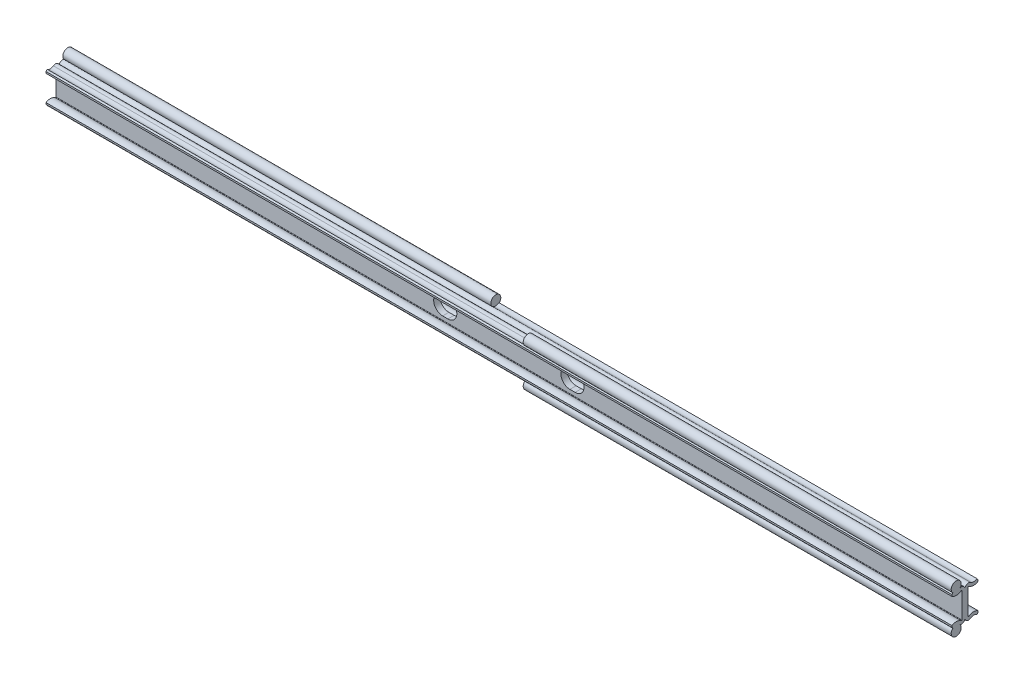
ISO-10303-21;
HEADER;
FILE_DESCRIPTION(('STEP AP214'),'2;1');
FILE_NAME('part.step','',(''),(''),'','','');
FILE_SCHEMA(('AUTOMOTIVE_DESIGN { 1 0 10303 214 1 1 1 1 }'));
ENDSEC;
DATA;
#1=APPLICATION_CONTEXT('core data for automotive mechanical design processes');
#2=APPLICATION_PROTOCOL_DEFINITION('international standard','automotive_design',2000,#1);
#3=PRODUCT_CONTEXT('',#1,'mechanical');
#4=PRODUCT('Part','Part','',(#3));
#5=PRODUCT_RELATED_PRODUCT_CATEGORY('part','',(#4));
#6=PRODUCT_DEFINITION_FORMATION('','',#4);
#7=PRODUCT_DEFINITION_CONTEXT('part definition',#1,'design');
#8=PRODUCT_DEFINITION('design','',#6,#7);
#9=PRODUCT_DEFINITION_SHAPE('','',#8);
#10=(LENGTH_UNIT() NAMED_UNIT(*) SI_UNIT(.MILLI.,.METRE.));
#11=(NAMED_UNIT(*) PLANE_ANGLE_UNIT() SI_UNIT($,.RADIAN.));
#12=(NAMED_UNIT(*) SI_UNIT($,.STERADIAN.) SOLID_ANGLE_UNIT());
#13=UNCERTAINTY_MEASURE_WITH_UNIT(LENGTH_MEASURE(1.E-05),#10,'distance_accuracy_value','');
#14=(GEOMETRIC_REPRESENTATION_CONTEXT(3) GLOBAL_UNCERTAINTY_ASSIGNED_CONTEXT((#13)) GLOBAL_UNIT_ASSIGNED_CONTEXT((#10,
#11,#12)) REPRESENTATION_CONTEXT('',''));
#15=CARTESIAN_POINT('',(0.,0.,0.));
#16=DIRECTION('',(0.,0.,1.));
#17=DIRECTION('',(1.,0.,0.));
#18=AXIS2_PLACEMENT_3D('',#15,#16,#17);
#19=CARTESIAN_POINT('',(-225.,9.67000022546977,4.31000011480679));
#20=DIRECTION('',(1.,0.,0.));
#21=DIRECTION('',(0.,0.,-1.));
#22=AXIS2_PLACEMENT_3D('',#19,#20,#21);
#23=CYLINDRICAL_SURFACE('',#22,2.48000011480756);
#24=CARTESIAN_POINT('',(12.4,9.67000022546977,4.31000011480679));
#25=DIRECTION('',(1.,0.,0.));
#26=DIRECTION('',(0.,0.,-1.));
#27=AXIS2_PLACEMENT_3D('',#24,#25,#26);
#28=CIRCLE('',#27,2.48000011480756);
#29=CARTESIAN_POINT('',(12.4,7.69573962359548,2.80910183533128));
#30=VERTEX_POINT('',#29);
#31=CARTESIAN_POINT('',(12.4,7.77020990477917,5.90411344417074));
#32=VERTEX_POINT('',#31);
#33=EDGE_CURVE('E323',#30,#32,#28,.F.);
#34=ORIENTED_EDGE('',*,*,#33,.F.);
#35=DIRECTION('',(1.,0.,0.));
#36=VECTOR('',#35,1.);
#37=CARTESIAN_POINT('',(-225.,7.69573962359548,2.80910183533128));
#38=LINE('',#37,#36);
#39=CARTESIAN_POINT('',(-225.,7.69573962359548,2.80910183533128));
#40=VERTEX_POINT('',#39);
#41=EDGE_CURVE('E545',#40,#30,#38,.T.);
#42=ORIENTED_EDGE('',*,*,#41,.F.);
#43=CARTESIAN_POINT('',(-225.,9.67000022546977,4.31000011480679));
#44=DIRECTION('',(1.,0.,0.));
#45=DIRECTION('',(0.,0.,-1.));
#46=AXIS2_PLACEMENT_3D('',#43,#44,#45);
#47=CIRCLE('',#46,2.48000011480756);
#48=CARTESIAN_POINT('',(-225.,7.77020990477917,5.90411344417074));
#49=VERTEX_POINT('',#48);
#50=EDGE_CURVE('E506',#49,#40,#47,.T.);
#51=ORIENTED_EDGE('',*,*,#50,.F.);
#52=DIRECTION('',(1.,0.,0.));
#53=VECTOR('',#52,1.);
#54=CARTESIAN_POINT('',(-225.,7.77020990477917,5.90411344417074));
#55=LINE('',#54,#53);
#56=EDGE_CURVE('E548',#49,#32,#55,.T.);
#57=ORIENTED_EDGE('',*,*,#56,.T.);
#58=EDGE_LOOP('',(#34,#42,#51,#57));
#59=FACE_BOUND('',#58,.T.);
#60=ADVANCED_FACE('F14',(#59),#23,.F.);
#61=CARTESIAN_POINT('',(-225.,9.67000022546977,-4.31000011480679));
#62=DIRECTION('',(1.,0.,0.));
#63=DIRECTION('',(0.,0.,-1.));
#64=AXIS2_PLACEMENT_3D('',#61,#62,#63);
#65=CYLINDRICAL_SURFACE('',#64,2.48000011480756);
#66=CARTESIAN_POINT('',(-12.4,9.67000022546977,-4.31000011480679));
#67=DIRECTION('',(-1.,0.,0.));
#68=DIRECTION('',(0.,0.,1.));
#69=AXIS2_PLACEMENT_3D('',#66,#67,#68);
#70=CIRCLE('',#69,2.48000011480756);
#71=CARTESIAN_POINT('',(-12.4,7.69573962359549,-2.80910183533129));
#72=VERTEX_POINT('',#71);
#73=CARTESIAN_POINT('',(-12.4,7.77020990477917,-5.90411344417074));
#74=VERTEX_POINT('',#73);
#75=EDGE_CURVE('E357',#72,#74,#70,.F.);
#76=ORIENTED_EDGE('',*,*,#75,.F.);
#77=DIRECTION('',(1.,0.,0.));
#78=VECTOR('',#77,1.);
#79=CARTESIAN_POINT('',(-225.,7.69573962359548,-2.80910183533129));
#80=LINE('',#79,#78);
#81=CARTESIAN_POINT('',(225.,7.69573962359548,-2.80910183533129));
#82=VERTEX_POINT('',#81);
#83=EDGE_CURVE('E540',#72,#82,#80,.T.);
#84=ORIENTED_EDGE('',*,*,#83,.T.);
#85=CARTESIAN_POINT('',(225.,9.67000022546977,-4.31000011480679));
#86=DIRECTION('',(1.,0.,0.));
#87=DIRECTION('',(0.,0.,1.));
#88=AXIS2_PLACEMENT_3D('',#85,#86,#87);
#89=CIRCLE('',#88,2.48000011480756);
#90=CARTESIAN_POINT('',(225.,7.77020990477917,-5.90411344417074));
#91=VERTEX_POINT('',#90);
#92=EDGE_CURVE('E459',#82,#91,#89,.T.);
#93=ORIENTED_EDGE('',*,*,#92,.T.);
#94=DIRECTION('',(1.,0.,0.));
#95=VECTOR('',#94,1.);
#96=CARTESIAN_POINT('',(-225.,7.77020990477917,-5.90411344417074));
#97=LINE('',#96,#95);
#98=EDGE_CURVE('E538',#74,#91,#97,.T.);
#99=ORIENTED_EDGE('',*,*,#98,.F.);
#100=EDGE_LOOP('',(#76,#84,#93,#99));
#101=FACE_BOUND('',#100,.T.);
#102=ADVANCED_FACE('F682',(#101),#65,.F.);
#103=CARTESIAN_POINT('',(-225.,-6.30261222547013,-1.75000011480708));
#104=DIRECTION('',(1.,0.,0.));
#105=DIRECTION('',(0.,0.,-1.));
#106=AXIS2_PLACEMENT_3D('',#103,#104,#105);
#107=CYLINDRICAL_SURFACE('',#106,0.200000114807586);
#108=CARTESIAN_POINT('',(225.,-6.30261222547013,-1.75000011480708));
#109=DIRECTION('',(1.,0.,0.));
#110=DIRECTION('',(0.,0.,-1.));
#111=AXIS2_PLACEMENT_3D('',#108,#109,#110);
#112=CIRCLE('',#111,0.200000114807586);
#113=CARTESIAN_POINT('',(225.,-6.30261222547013,-1.54999999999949));
#114=VERTEX_POINT('',#113);
#115=CARTESIAN_POINT('',(225.,-6.46182696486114,-1.87104024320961));
#116=VERTEX_POINT('',#115);
#117=EDGE_CURVE('E423',#114,#116,#112,.T.);
#118=ORIENTED_EDGE('',*,*,#117,.T.);
#119=DIRECTION('',(1.,0.,0.));
#120=VECTOR('',#119,1.);
#121=CARTESIAN_POINT('',(-225.,-6.46182696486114,-1.87104024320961));
#122=LINE('',#121,#120);
#123=CARTESIAN_POINT('',(-225.,-6.46182696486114,-1.87104024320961));
#124=VERTEX_POINT('',#123);
#125=EDGE_CURVE('E591',#124,#116,#122,.T.);
#126=ORIENTED_EDGE('',*,*,#125,.F.);
#127=CARTESIAN_POINT('',(-225.,-6.30261222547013,-1.75000011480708));
#128=DIRECTION('',(1.,0.,0.));
#129=DIRECTION('',(0.,0.,-1.));
#130=AXIS2_PLACEMENT_3D('',#127,#128,#129);
#131=CIRCLE('',#130,0.200000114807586);
#132=CARTESIAN_POINT('',(-225.,-6.30261222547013,-1.54999999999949));
#133=VERTEX_POINT('',#132);
#134=EDGE_CURVE('E472',#133,#124,#131,.T.);
#135=ORIENTED_EDGE('',*,*,#134,.F.);
#136=DIRECTION('',(1.,0.,0.));
#137=VECTOR('',#136,1.);
#138=CARTESIAN_POINT('',(-225.,-6.30261222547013,-1.54999999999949));
#139=LINE('',#138,#137);
#140=EDGE_CURVE('E523',#133,#114,#139,.T.);
#141=ORIENTED_EDGE('',*,*,#140,.T.);
#142=EDGE_LOOP('',(#118,#126,#135,#141));
#143=FACE_BOUND('',#142,.T.);
#144=ADVANCED_FACE('F16',(#143),#107,.F.);
#145=CARTESIAN_POINT('',(-225.,-9.67000022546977,-4.31000011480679));
#146=DIRECTION('',(1.,0.,0.));
#147=DIRECTION('',(0.,0.,-1.));
#148=AXIS2_PLACEMENT_3D('',#145,#146,#147);
#149=CYLINDRICAL_SURFACE('',#148,4.03000011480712);
#150=CARTESIAN_POINT('',(225.,-9.67000022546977,-4.31000011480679));
#151=DIRECTION('',(-1.,0.,0.));
#152=DIRECTION('',(0.,0.,-1.));
#153=AXIS2_PLACEMENT_3D('',#150,#151,#152);
#154=CIRCLE('',#153,4.03000011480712);
#155=CARTESIAN_POINT('',(225.,-6.26775086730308,-6.47000016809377));
#156=VERTEX_POINT('',#155);
#157=EDGE_CURVE('E426',#116,#156,#154,.T.);
#158=ORIENTED_EDGE('',*,*,#157,.T.);
#159=DIRECTION('',(1.,0.,0.));
#160=VECTOR('',#159,1.);
#161=CARTESIAN_POINT('',(-225.,-6.26775086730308,-6.47000016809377));
#162=LINE('',#161,#160);
#163=CARTESIAN_POINT('',(-225.,-6.26775086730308,-6.47000016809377));
#164=VERTEX_POINT('',#163);
#165=EDGE_CURVE('E588',#164,#156,#162,.T.);
#166=ORIENTED_EDGE('',*,*,#165,.F.);
#167=CARTESIAN_POINT('',(-225.,-9.67000022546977,-4.31000011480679));
#168=DIRECTION('',(-1.,0.,0.));
#169=DIRECTION('',(0.,0.,-1.));
#170=AXIS2_PLACEMENT_3D('',#167,#168,#169);
#171=CIRCLE('',#170,4.03000011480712);
#172=EDGE_CURVE('E475',#124,#164,#171,.T.);
#173=ORIENTED_EDGE('',*,*,#172,.F.);
#174=ORIENTED_EDGE('',*,*,#125,.T.);
#175=EDGE_LOOP('',(#158,#166,#173,#174));
#176=FACE_BOUND('',#175,.T.);
#177=ADVANCED_FACE('F731',(#176),#149,.T.);
#178=CARTESIAN_POINT('',(-225.,-6.26775086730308,-6.47000016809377));
#179=DIRECTION('',(0.,0.,1.));
#180=DIRECTION('',(1.,0.,0.));
#181=AXIS2_PLACEMENT_3D('',#178,#179,#180);
#182=PLANE('',#181);
#183=DIRECTION('',(0.,-1.,0.));
#184=VECTOR('',#183,1.);
#185=CARTESIAN_POINT('',(225.,-6.26775086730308,-6.47000016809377));
#186=LINE('',#185,#184);
#187=CARTESIAN_POINT('',(225.,-7.09581212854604,-6.47000016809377));
#188=VERTEX_POINT('',#187);
#189=EDGE_CURVE('E428',#156,#188,#186,.T.);
#190=ORIENTED_EDGE('',*,*,#189,.T.);
#191=DIRECTION('',(1.,0.,0.));
#192=VECTOR('',#191,1.);
#193=CARTESIAN_POINT('',(-225.,-7.09581212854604,-6.47000016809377));
#194=LINE('',#193,#192);
#195=CARTESIAN_POINT('',(-225.,-7.09581212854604,-6.47000016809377));
#196=VERTEX_POINT('',#195);
#197=EDGE_CURVE('E585',#196,#188,#194,.T.);
#198=ORIENTED_EDGE('',*,*,#197,.F.);
#199=DIRECTION('',(0.,-1.,0.));
#200=VECTOR('',#199,1.);
#201=CARTESIAN_POINT('',(-225.,-6.26775086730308,-6.47000016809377));
#202=LINE('',#201,#200);
#203=EDGE_CURVE('E477',#164,#196,#202,.T.);
#204=ORIENTED_EDGE('',*,*,#203,.F.);
#205=ORIENTED_EDGE('',*,*,#165,.T.);
#206=EDGE_LOOP('',(#190,#198,#204,#205));
#207=FACE_BOUND('',#206,.T.);
#208=ADVANCED_FACE('F728',(#207),#182,.F.);
#209=CARTESIAN_POINT('',(-225.,-7.77020990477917,-5.90411344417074));
#210=DIRECTION('',(0.,0.642787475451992,0.766044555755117));
#211=DIRECTION('',(0.,0.766044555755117,-0.642787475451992));
#212=AXIS2_PLACEMENT_3D('',#209,#210,#211);
#213=PLANE('',#212);
#214=DIRECTION('',(0.,0.766044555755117,-0.642787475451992));
#215=VECTOR('',#214,1.);
#216=CARTESIAN_POINT('',(-12.4,-7.77020990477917,-5.90411344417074));
#217=LINE('',#216,#215);
#218=CARTESIAN_POINT('',(-12.4,-7.77020990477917,-5.90411344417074));
#219=VERTEX_POINT('',#218);
#220=CARTESIAN_POINT('',(-12.4,-7.62948341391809,-6.02219694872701));
#221=VERTEX_POINT('',#220);
#222=EDGE_CURVE('E343',#219,#221,#217,.T.);
#223=ORIENTED_EDGE('',*,*,#222,.T.);
#224=DIRECTION('',(-1.,0.,0.));
#225=VECTOR('',#224,1.);
#226=CARTESIAN_POINT('',(-12.4,-7.62948341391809,-6.02219694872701));
#227=LINE('',#226,#225);
#228=CARTESIAN_POINT('',(-225.,-7.62948341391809,-6.02219694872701));
#229=VERTEX_POINT('',#228);
#230=EDGE_CURVE('E337',#221,#229,#227,.T.);
#231=ORIENTED_EDGE('',*,*,#230,.T.);
#232=DIRECTION('',(0.,-0.766044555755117,0.642787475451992));
#233=VECTOR('',#232,1.);
#234=CARTESIAN_POINT('',(-225.,-7.77020990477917,-5.90411344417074));
#235=LINE('',#234,#233);
#236=EDGE_CURVE('E479',#196,#229,#235,.T.);
#237=ORIENTED_EDGE('',*,*,#236,.F.);
#238=ORIENTED_EDGE('',*,*,#197,.T.);
#239=DIRECTION('',(0.,-0.766044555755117,0.642787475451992));
#240=VECTOR('',#239,1.);
#241=CARTESIAN_POINT('',(225.,-7.77020990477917,-5.90411344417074));
#242=LINE('',#241,#240);
#243=CARTESIAN_POINT('',(225.,-7.77020990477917,-5.90411344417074));
#244=VERTEX_POINT('',#243);
#245=EDGE_CURVE('E430',#188,#244,#242,.T.);
#246=ORIENTED_EDGE('',*,*,#245,.T.);
#247=DIRECTION('',(1.,0.,0.));
#248=VECTOR('',#247,1.);
#249=CARTESIAN_POINT('',(-225.,-7.77020990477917,-5.90411344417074));
#250=LINE('',#249,#248);
#251=EDGE_CURVE('E583',#219,#244,#250,.T.);
#252=ORIENTED_EDGE('',*,*,#251,.F.);
#253=EDGE_LOOP('',(#223,#231,#237,#238,#246,#252));
#254=FACE_BOUND('',#253,.T.);
#255=ADVANCED_FACE('F724',(#254),#213,.F.);
#256=CARTESIAN_POINT('',(-225.,-9.67000022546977,-4.31000011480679));
#257=DIRECTION('',(1.,0.,0.));
#258=DIRECTION('',(0.,0.,-1.));
#259=AXIS2_PLACEMENT_3D('',#256,#257,#258);
#260=CYLINDRICAL_SURFACE('',#259,2.48000011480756);
#261=DIRECTION('',(1.,0.,0.));
#262=VECTOR('',#261,1.);
#263=CARTESIAN_POINT('',(-225.,-7.69573962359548,-2.80910183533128));
#264=LINE('',#263,#262);
#265=CARTESIAN_POINT('',(-12.4,-7.69573962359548,-2.80910183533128));
#266=VERTEX_POINT('',#265);
#267=CARTESIAN_POINT('',(225.,-7.69573962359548,-2.80910183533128));
#268=VERTEX_POINT('',#267);
#269=EDGE_CURVE('E581',#266,#268,#264,.T.);
#270=ORIENTED_EDGE('',*,*,#269,.F.);
#271=CARTESIAN_POINT('',(-12.4,-9.67000022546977,-4.31000011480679));
#272=DIRECTION('',(1.,0.,0.));
#273=DIRECTION('',(0.,0.,-1.));
#274=AXIS2_PLACEMENT_3D('',#271,#272,#273);
#275=CIRCLE('',#274,2.48000011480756);
#276=EDGE_CURVE('E340',#266,#219,#275,.F.);
#277=ORIENTED_EDGE('',*,*,#276,.T.);
#278=ORIENTED_EDGE('',*,*,#251,.T.);
#279=CARTESIAN_POINT('',(225.,-9.67000022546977,-4.31000011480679));
#280=DIRECTION('',(1.,0.,0.));
#281=DIRECTION('',(0.,0.,-1.));
#282=AXIS2_PLACEMENT_3D('',#279,#280,#281);
#283=CIRCLE('',#282,2.48000011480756);
#284=EDGE_CURVE('E433',#244,#268,#283,.T.);
#285=ORIENTED_EDGE('',*,*,#284,.T.);
#286=EDGE_LOOP('',(#270,#277,#278,#285));
#287=FACE_BOUND('',#286,.T.);
#288=ADVANCED_FACE('F720',(#287),#260,.F.);
#289=CARTESIAN_POINT('',(-225.,-6.30261222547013,-1.75000011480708));
#290=DIRECTION('',(1.,0.,0.));
#291=DIRECTION('',(0.,0.,-1.));
#292=AXIS2_PLACEMENT_3D('',#289,#290,#291);
#293=CYLINDRICAL_SURFACE('',#292,1.75000011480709);
#294=CARTESIAN_POINT('',(-225.,-6.30261222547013,-1.75000011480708));
#295=DIRECTION('',(-1.,0.,0.));
#296=DIRECTION('',(0.,0.,-1.));
#297=AXIS2_PLACEMENT_3D('',#294,#295,#296);
#298=CIRCLE('',#297,1.75000011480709);
#299=CARTESIAN_POINT('',(-225.,-7.91637379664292,-2.42695948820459));
#300=VERTEX_POINT('',#299);
#301=CARTESIAN_POINT('',(-225.,-6.30261222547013,0.));
#302=VERTEX_POINT('',#301);
#303=EDGE_CURVE('E482',#300,#302,#298,.T.);
#304=ORIENTED_EDGE('',*,*,#303,.F.);
#305=DIRECTION('',(-1.,0.,0.));
#306=VECTOR('',#305,1.);
#307=CARTESIAN_POINT('',(-118.7,-7.91637379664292,-2.42695948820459));
#308=LINE('',#307,#306);
#309=CARTESIAN_POINT('',(-12.4,-7.91637379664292,-2.42695948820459));
#310=VERTEX_POINT('',#309);
#311=EDGE_CURVE('E333',#300,#310,#308,.F.);
#312=ORIENTED_EDGE('',*,*,#311,.T.);
#313=CARTESIAN_POINT('',(-12.4,-6.30261222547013,-1.75000011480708));
#314=DIRECTION('',(1.,0.,0.));
#315=DIRECTION('',(0.,0.,-1.));
#316=AXIS2_PLACEMENT_3D('',#313,#314,#315);
#317=CIRCLE('',#316,1.75000011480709);
#318=EDGE_CURVE('E596',#310,#266,#317,.T.);
#319=ORIENTED_EDGE('',*,*,#318,.T.);
#320=ORIENTED_EDGE('',*,*,#269,.T.);
#321=CARTESIAN_POINT('',(225.,-6.30261222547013,-1.75000011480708));
#322=DIRECTION('',(-1.,0.,0.));
#323=DIRECTION('',(0.,0.,-1.));
#324=AXIS2_PLACEMENT_3D('',#321,#322,#323);
#325=CIRCLE('',#324,1.75000011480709);
#326=CARTESIAN_POINT('',(225.,-6.30261222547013,0.));
#327=VERTEX_POINT('',#326);
#328=EDGE_CURVE('E436',#268,#327,#325,.T.);
#329=ORIENTED_EDGE('',*,*,#328,.T.);
#330=DIRECTION('',(1.,0.,0.));
#331=VECTOR('',#330,1.);
#332=CARTESIAN_POINT('',(-225.,-6.30261222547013,0.));
#333=LINE('',#332,#331);
#334=EDGE_CURVE('E578',#302,#327,#333,.T.);
#335=ORIENTED_EDGE('',*,*,#334,.F.);
#336=EDGE_LOOP('',(#304,#312,#319,#320,#329,#335));
#337=FACE_BOUND('',#336,.T.);
#338=ADVANCED_FACE('F717',(#337),#293,.T.);
#339=CARTESIAN_POINT('',(-225.,-6.30261222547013,1.75000011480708));
#340=DIRECTION('',(1.,0.,0.));
#341=DIRECTION('',(0.,0.,-1.));
#342=AXIS2_PLACEMENT_3D('',#339,#340,#341);
#343=CYLINDRICAL_SURFACE('',#342,1.75000011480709);
#344=CARTESIAN_POINT('',(225.,-6.30261222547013,1.75000011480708));
#345=DIRECTION('',(-1.,0.,0.));
#346=DIRECTION('',(0.,0.,1.));
#347=AXIS2_PLACEMENT_3D('',#344,#345,#346);
#348=CIRCLE('',#347,1.75000011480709);
#349=CARTESIAN_POINT('',(225.,-7.91637379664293,2.42695948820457));
#350=VERTEX_POINT('',#349);
#351=EDGE_CURVE('E292',#327,#350,#348,.T.);
#352=ORIENTED_EDGE('',*,*,#351,.T.);
#353=DIRECTION('',(1.,0.,0.));
#354=VECTOR('',#353,1.);
#355=CARTESIAN_POINT('',(118.7,-7.91637379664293,2.42695948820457));
#356=LINE('',#355,#354);
#357=CARTESIAN_POINT('',(12.4,-7.91637379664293,2.42695948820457));
#358=VERTEX_POINT('',#357);
#359=EDGE_CURVE('E29',#350,#358,#356,.F.);
#360=ORIENTED_EDGE('',*,*,#359,.T.);
#361=CARTESIAN_POINT('',(12.4,-6.30261222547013,1.75000011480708));
#362=DIRECTION('',(-1.,0.,0.));
#363=DIRECTION('',(0.,0.,1.));
#364=AXIS2_PLACEMENT_3D('',#361,#362,#363);
#365=CIRCLE('',#364,1.75000011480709);
#366=CARTESIAN_POINT('',(12.4,-7.69573962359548,2.80910183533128));
#367=VERTEX_POINT('',#366);
#368=EDGE_CURVE('E33',#358,#367,#365,.T.);
#369=ORIENTED_EDGE('',*,*,#368,.T.);
#370=DIRECTION('',(1.,0.,0.));
#371=VECTOR('',#370,1.);
#372=CARTESIAN_POINT('',(-225.,-7.69573962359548,2.80910183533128));
#373=LINE('',#372,#371);
#374=CARTESIAN_POINT('',(-225.,-7.69573962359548,2.80910183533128));
#375=VERTEX_POINT('',#374);
#376=EDGE_CURVE('E576',#375,#367,#373,.T.);
#377=ORIENTED_EDGE('',*,*,#376,.F.);
#378=CARTESIAN_POINT('',(-225.,-6.30261222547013,1.75000011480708));
#379=DIRECTION('',(-1.,0.,0.));
#380=DIRECTION('',(0.,0.,1.));
#381=AXIS2_PLACEMENT_3D('',#378,#379,#380);
#382=CIRCLE('',#381,1.75000011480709);
#383=EDGE_CURVE('E484',#302,#375,#382,.T.);
#384=ORIENTED_EDGE('',*,*,#383,.F.);
#385=ORIENTED_EDGE('',*,*,#334,.T.);
#386=EDGE_LOOP('',(#352,#360,#369,#377,#384,#385));
#387=FACE_BOUND('',#386,.T.);
#388=ADVANCED_FACE('F714',(#387),#343,.T.);
#389=CARTESIAN_POINT('',(-225.,-9.67000022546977,4.31000011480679));
#390=DIRECTION('',(1.,0.,0.));
#391=DIRECTION('',(0.,0.,-1.));
#392=AXIS2_PLACEMENT_3D('',#389,#390,#391);
#393=CYLINDRICAL_SURFACE('',#392,2.48000011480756);
#394=ORIENTED_EDGE('',*,*,#376,.T.);
#395=CARTESIAN_POINT('',(12.4,-9.67000022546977,4.31000011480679));
#396=DIRECTION('',(-1.,0.,0.));
#397=DIRECTION('',(0.,0.,1.));
#398=AXIS2_PLACEMENT_3D('',#395,#396,#397);
#399=CIRCLE('',#398,2.48000011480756);
#400=CARTESIAN_POINT('',(12.4,-7.77020990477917,5.90411344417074));
#401=VERTEX_POINT('',#400);
#402=EDGE_CURVE('E309',#367,#401,#399,.F.);
#403=ORIENTED_EDGE('',*,*,#402,.T.);
#404=DIRECTION('',(1.,0.,0.));
#405=VECTOR('',#404,1.);
#406=CARTESIAN_POINT('',(-225.,-7.77020990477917,5.90411344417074));
#407=LINE('',#406,#405);
#408=CARTESIAN_POINT('',(-225.,-7.77020990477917,5.90411344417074));
#409=VERTEX_POINT('',#408);
#410=EDGE_CURVE('E574',#409,#401,#407,.T.);
#411=ORIENTED_EDGE('',*,*,#410,.F.);
#412=CARTESIAN_POINT('',(-225.,-9.67000022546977,4.31000011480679));
#413=DIRECTION('',(1.,0.,0.));
#414=DIRECTION('',(0.,0.,1.));
#415=AXIS2_PLACEMENT_3D('',#412,#413,#414);
#416=CIRCLE('',#415,2.48000011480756);
#417=EDGE_CURVE('E486',#375,#409,#416,.T.);
#418=ORIENTED_EDGE('',*,*,#417,.F.);
#419=EDGE_LOOP('',(#394,#403,#411,#418));
#420=FACE_BOUND('',#419,.T.);
#421=ADVANCED_FACE('F667',(#420),#393,.F.);
#422=CARTESIAN_POINT('',(-225.,-7.77020990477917,5.90411344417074));
#423=DIRECTION('',(0.,0.642787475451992,-0.766044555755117));
#424=DIRECTION('',(0.,-0.766044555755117,-0.642787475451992));
#425=AXIS2_PLACEMENT_3D('',#422,#423,#424);
#426=PLANE('',#425);
#427=DIRECTION('',(0.,0.766044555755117,0.642787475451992));
#428=VECTOR('',#427,1.);
#429=CARTESIAN_POINT('',(12.4,-7.77020990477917,5.90411344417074));
#430=LINE('',#429,#428);
#431=CARTESIAN_POINT('',(12.4,-7.62948341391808,6.02219694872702));
#432=VERTEX_POINT('',#431);
#433=EDGE_CURVE('E9',#401,#432,#430,.T.);
#434=ORIENTED_EDGE('',*,*,#433,.T.);
#435=DIRECTION('',(1.,0.,0.));
#436=VECTOR('',#435,1.);
#437=CARTESIAN_POINT('',(12.4,-7.62948341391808,6.02219694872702));
#438=LINE('',#437,#436);
#439=CARTESIAN_POINT('',(225.,-7.62948341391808,6.02219694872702));
#440=VERTEX_POINT('',#439);
#441=EDGE_CURVE('E295',#432,#440,#438,.T.);
#442=ORIENTED_EDGE('',*,*,#441,.T.);
#443=DIRECTION('',(0.,0.766044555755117,0.642787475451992));
#444=VECTOR('',#443,1.);
#445=CARTESIAN_POINT('',(225.,-7.77020990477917,5.90411344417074));
#446=LINE('',#445,#444);
#447=CARTESIAN_POINT('',(225.,-7.09581212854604,6.47000016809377));
#448=VERTEX_POINT('',#447);
#449=EDGE_CURVE('E281',#440,#448,#446,.T.);
#450=ORIENTED_EDGE('',*,*,#449,.T.);
#451=DIRECTION('',(1.,0.,0.));
#452=VECTOR('',#451,1.);
#453=CARTESIAN_POINT('',(-225.,-7.09581212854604,6.47000016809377));
#454=LINE('',#453,#452);
#455=CARTESIAN_POINT('',(-225.,-7.09581212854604,6.47000016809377));
#456=VERTEX_POINT('',#455);
#457=EDGE_CURVE('E572',#456,#448,#454,.T.);
#458=ORIENTED_EDGE('',*,*,#457,.F.);
#459=DIRECTION('',(0.,0.766044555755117,0.642787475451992));
#460=VECTOR('',#459,1.);
#461=CARTESIAN_POINT('',(-225.,-7.77020990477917,5.90411344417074));
#462=LINE('',#461,#460);
#463=EDGE_CURVE('E488',#409,#456,#462,.T.);
#464=ORIENTED_EDGE('',*,*,#463,.F.);
#465=ORIENTED_EDGE('',*,*,#410,.T.);
#466=EDGE_LOOP('',(#434,#442,#450,#458,#464,#465));
#467=FACE_BOUND('',#466,.T.);
#468=ADVANCED_FACE('F296',(#467),#426,.F.);
#469=CARTESIAN_POINT('',(-225.,-6.26775086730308,6.47000016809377));
#470=DIRECTION('',(0.,0.,-1.));
#471=DIRECTION('',(-1.,0.,0.));
#472=AXIS2_PLACEMENT_3D('',#469,#470,#471);
#473=PLANE('',#472);
#474=DIRECTION('',(0.,1.,0.));
#475=VECTOR('',#474,1.);
#476=CARTESIAN_POINT('',(225.,-6.26775086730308,6.47000016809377));
#477=LINE('',#476,#475);
#478=CARTESIAN_POINT('',(225.,-6.26775086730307,6.47000016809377));
#479=VERTEX_POINT('',#478);
#480=EDGE_CURVE('E288',#448,#479,#477,.T.);
#481=ORIENTED_EDGE('',*,*,#480,.T.);
#482=DIRECTION('',(1.,0.,0.));
#483=VECTOR('',#482,1.);
#484=CARTESIAN_POINT('',(-225.,-6.26775086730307,6.47000016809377));
#485=LINE('',#484,#483);
#486=CARTESIAN_POINT('',(-225.,-6.26775086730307,6.47000016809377));
#487=VERTEX_POINT('',#486);
#488=EDGE_CURVE('E569',#487,#479,#485,.T.);
#489=ORIENTED_EDGE('',*,*,#488,.F.);
#490=DIRECTION('',(0.,1.,0.));
#491=VECTOR('',#490,1.);
#492=CARTESIAN_POINT('',(-225.,-6.26775086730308,6.47000016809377));
#493=LINE('',#492,#491);
#494=EDGE_CURVE('E490',#456,#487,#493,.T.);
#495=ORIENTED_EDGE('',*,*,#494,.F.);
#496=ORIENTED_EDGE('',*,*,#457,.T.);
#497=EDGE_LOOP('',(#481,#489,#495,#496));
#498=FACE_BOUND('',#497,.T.);
#499=ADVANCED_FACE('F661',(#498),#473,.F.);
#500=CARTESIAN_POINT('',(-225.,-9.67000022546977,4.31000011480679));
#501=DIRECTION('',(1.,0.,0.));
#502=DIRECTION('',(0.,0.,-1.));
#503=AXIS2_PLACEMENT_3D('',#500,#501,#502);
#504=CYLINDRICAL_SURFACE('',#503,4.03000011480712);
#505=CARTESIAN_POINT('',(225.,-9.67000022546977,4.31000011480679));
#506=DIRECTION('',(-1.,0.,0.));
#507=DIRECTION('',(0.,0.,1.));
#508=AXIS2_PLACEMENT_3D('',#505,#506,#507);
#509=CIRCLE('',#508,4.03000011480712);
#510=CARTESIAN_POINT('',(225.,-6.46182696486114,1.87104024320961));
#511=VERTEX_POINT('',#510);
#512=EDGE_CURVE('E440',#479,#511,#509,.T.);
#513=ORIENTED_EDGE('',*,*,#512,.T.);
#514=DIRECTION('',(1.,0.,0.));
#515=VECTOR('',#514,1.);
#516=CARTESIAN_POINT('',(-225.,-6.46182696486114,1.87104024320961));
#517=LINE('',#516,#515);
#518=CARTESIAN_POINT('',(-225.,-6.46182696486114,1.87104024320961));
#519=VERTEX_POINT('',#518);
#520=EDGE_CURVE('E566',#519,#511,#517,.T.);
#521=ORIENTED_EDGE('',*,*,#520,.F.);
#522=CARTESIAN_POINT('',(-225.,-9.67000022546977,4.31000011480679));
#523=DIRECTION('',(-1.,0.,0.));
#524=DIRECTION('',(0.,0.,1.));
#525=AXIS2_PLACEMENT_3D('',#522,#523,#524);
#526=CIRCLE('',#525,4.03000011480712);
#527=EDGE_CURVE('E492',#487,#519,#526,.T.);
#528=ORIENTED_EDGE('',*,*,#527,.F.);
#529=ORIENTED_EDGE('',*,*,#488,.T.);
#530=EDGE_LOOP('',(#513,#521,#528,#529));
#531=FACE_BOUND('',#530,.T.);
#532=ADVANCED_FACE('F657',(#531),#504,.T.);
#533=CARTESIAN_POINT('',(-225.,-6.30261222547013,1.75000011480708));
#534=DIRECTION('',(1.,0.,0.));
#535=DIRECTION('',(0.,0.,-1.));
#536=AXIS2_PLACEMENT_3D('',#533,#534,#535);
#537=CYLINDRICAL_SURFACE('',#536,0.200000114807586);
#538=CARTESIAN_POINT('',(225.,-6.30261222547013,1.75000011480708));
#539=DIRECTION('',(1.,0.,0.));
#540=DIRECTION('',(0.,0.,1.));
#541=AXIS2_PLACEMENT_3D('',#538,#539,#540);
#542=CIRCLE('',#541,0.200000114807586);
#543=CARTESIAN_POINT('',(225.,-6.30261222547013,1.54999999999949));
#544=VERTEX_POINT('',#543);
#545=EDGE_CURVE('E442',#511,#544,#542,.T.);
#546=ORIENTED_EDGE('',*,*,#545,.T.);
#547=DIRECTION('',(1.,0.,0.));
#548=VECTOR('',#547,1.);
#549=CARTESIAN_POINT('',(-225.,-6.30261222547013,1.54999999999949));
#550=LINE('',#549,#548);
#551=CARTESIAN_POINT('',(-225.,-6.30261222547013,1.54999999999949));
#552=VERTEX_POINT('',#551);
#553=EDGE_CURVE('E563',#552,#544,#550,.T.);
#554=ORIENTED_EDGE('',*,*,#553,.F.);
#555=CARTESIAN_POINT('',(-225.,-6.30261222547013,1.75000011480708));
#556=DIRECTION('',(1.,0.,0.));
#557=DIRECTION('',(0.,0.,1.));
#558=AXIS2_PLACEMENT_3D('',#555,#556,#557);
#559=CIRCLE('',#558,0.200000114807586);
#560=EDGE_CURVE('E494',#519,#552,#559,.T.);
#561=ORIENTED_EDGE('',*,*,#560,.F.);
#562=ORIENTED_EDGE('',*,*,#520,.T.);
#563=EDGE_LOOP('',(#546,#554,#561,#562));
#564=FACE_BOUND('',#563,.T.);
#565=ADVANCED_FACE('F652',(#564),#537,.F.);
#566=CARTESIAN_POINT('',(-225.,-6.30261222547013,1.54999999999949));
#567=DIRECTION('',(0.,0.,-1.));
#568=DIRECTION('',(-1.,0.,0.));
#569=AXIS2_PLACEMENT_3D('',#566,#567,#568);
#570=PLANE('',#569);
#571=DIRECTION('',(1.,0.,0.));
#572=VECTOR('',#571,1.);
#573=CARTESIAN_POINT('',(-32.9,-4.45,1.54999999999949));
#574=LINE('',#573,#572);
#575=CARTESIAN_POINT('',(-32.9,-4.45,1.54999999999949));
#576=VERTEX_POINT('',#575);
#577=CARTESIAN_POINT('',(-30.3,-4.45,1.54999999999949));
#578=VERTEX_POINT('',#577);
#579=EDGE_CURVE('E371',#576,#578,#574,.T.);
#580=ORIENTED_EDGE('',*,*,#579,.F.);
#581=CARTESIAN_POINT('',(-32.9,0.,1.54999999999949));
#582=DIRECTION('',(0.,0.,1.));
#583=DIRECTION('',(-1.,0.,0.));
#584=AXIS2_PLACEMENT_3D('',#581,#582,#583);
#585=CIRCLE('',#584,4.45);
#586=CARTESIAN_POINT('',(-32.9,4.45,1.54999999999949));
#587=VERTEX_POINT('',#586);
#588=EDGE_CURVE('E369',#587,#576,#585,.T.);
#589=ORIENTED_EDGE('',*,*,#588,.F.);
#590=DIRECTION('',(-1.,0.,0.));
#591=VECTOR('',#590,1.);
#592=CARTESIAN_POINT('',(-30.3,4.45,1.54999999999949));
#593=LINE('',#592,#591);
#594=CARTESIAN_POINT('',(-30.3,4.45,1.54999999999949));
#595=VERTEX_POINT('',#594);
#596=EDGE_CURVE('E377',#595,#587,#593,.T.);
#597=ORIENTED_EDGE('',*,*,#596,.F.);
#598=CARTESIAN_POINT('',(-30.3,0.,1.54999999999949));
#599=DIRECTION('',(0.,0.,1.));
#600=DIRECTION('',(-1.,0.,0.));
#601=AXIS2_PLACEMENT_3D('',#598,#599,#600);
#602=CIRCLE('',#601,4.45);
#603=EDGE_CURVE('E374',#578,#595,#602,.T.);
#604=ORIENTED_EDGE('',*,*,#603,.F.);
#605=EDGE_LOOP('',(#580,#589,#597,#604));
#606=FACE_BOUND('',#605,.T.);
#607=DIRECTION('',(1.,0.,0.));
#608=VECTOR('',#607,1.);
#609=CARTESIAN_POINT('',(32.9,-4.45,1.54999999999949));
#610=LINE('',#609,#608);
#611=CARTESIAN_POINT('',(30.3,-4.45,1.54999999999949));
#612=VERTEX_POINT('',#611);
#613=CARTESIAN_POINT('',(32.9,-4.45,1.54999999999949));
#614=VERTEX_POINT('',#613);
#615=EDGE_CURVE('E402',#612,#614,#610,.T.);
#616=ORIENTED_EDGE('',*,*,#615,.F.);
#617=CARTESIAN_POINT('',(30.3,0.,1.54999999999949));
#618=DIRECTION('',(0.,0.,1.));
#619=DIRECTION('',(1.,0.,0.));
#620=AXIS2_PLACEMENT_3D('',#617,#618,#619);
#621=CIRCLE('',#620,4.45);
#622=CARTESIAN_POINT('',(30.3,4.45,1.54999999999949));
#623=VERTEX_POINT('',#622);
#624=EDGE_CURVE('E400',#623,#612,#621,.T.);
#625=ORIENTED_EDGE('',*,*,#624,.F.);
#626=DIRECTION('',(-1.,0.,0.));
#627=VECTOR('',#626,1.);
#628=CARTESIAN_POINT('',(30.3,4.45,1.54999999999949));
#629=LINE('',#628,#627);
#630=CARTESIAN_POINT('',(32.9,4.45,1.54999999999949));
#631=VERTEX_POINT('',#630);
#632=EDGE_CURVE('E408',#631,#623,#629,.T.);
#633=ORIENTED_EDGE('',*,*,#632,.F.);
#634=CARTESIAN_POINT('',(32.9,0.,1.54999999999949));
#635=DIRECTION('',(0.,0.,1.));
#636=DIRECTION('',(1.,0.,0.));
#637=AXIS2_PLACEMENT_3D('',#634,#635,#636);
#638=CIRCLE('',#637,4.45);
#639=EDGE_CURVE('E405',#614,#631,#638,.T.);
#640=ORIENTED_EDGE('',*,*,#639,.F.);
#641=EDGE_LOOP('',(#616,#625,#633,#640));
#642=FACE_BOUND('',#641,.T.);
#643=DIRECTION('',(0.,1.,0.));
#644=VECTOR('',#643,1.);
#645=CARTESIAN_POINT('',(225.,-6.30261222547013,1.54999999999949));
#646=LINE('',#645,#644);
#647=CARTESIAN_POINT('',(225.,6.30261222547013,1.54999999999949));
#648=VERTEX_POINT('',#647);
#649=EDGE_CURVE('E444',#544,#648,#646,.T.);
#650=ORIENTED_EDGE('',*,*,#649,.T.);
#651=DIRECTION('',(1.,0.,0.));
#652=VECTOR('',#651,1.);
#653=CARTESIAN_POINT('',(-225.,6.30261222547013,1.54999999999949));
#654=LINE('',#653,#652);
#655=CARTESIAN_POINT('',(-225.,6.30261222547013,1.54999999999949));
#656=VERTEX_POINT('',#655);
#657=EDGE_CURVE('E560',#656,#648,#654,.T.);
#658=ORIENTED_EDGE('',*,*,#657,.F.);
#659=DIRECTION('',(0.,1.,0.));
#660=VECTOR('',#659,1.);
#661=CARTESIAN_POINT('',(-225.,-6.30261222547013,1.54999999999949));
#662=LINE('',#661,#660);
#663=EDGE_CURVE('E496',#552,#656,#662,.T.);
#664=ORIENTED_EDGE('',*,*,#663,.F.);
#665=ORIENTED_EDGE('',*,*,#553,.T.);
#666=EDGE_LOOP('',(#650,#658,#664,#665));
#667=FACE_BOUND('',#666,.T.);
#668=ADVANCED_FACE('F648',(#606,#642,#667),#570,.F.);
#669=CARTESIAN_POINT('',(-225.,6.30261222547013,1.75000011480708));
#670=DIRECTION('',(1.,0.,0.));
#671=DIRECTION('',(0.,0.,-1.));
#672=AXIS2_PLACEMENT_3D('',#669,#670,#671);
#673=CYLINDRICAL_SURFACE('',#672,0.200000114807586);
#674=CARTESIAN_POINT('',(225.,6.30261222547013,1.75000011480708));
#675=DIRECTION('',(1.,0.,0.));
#676=DIRECTION('',(0.,0.,-1.));
#677=AXIS2_PLACEMENT_3D('',#674,#675,#676);
#678=CIRCLE('',#677,0.200000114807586);
#679=CARTESIAN_POINT('',(225.,6.46182696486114,1.87104024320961));
#680=VERTEX_POINT('',#679);
#681=EDGE_CURVE('E446',#648,#680,#678,.T.);
#682=ORIENTED_EDGE('',*,*,#681,.T.);
#683=DIRECTION('',(1.,0.,0.));
#684=VECTOR('',#683,1.);
#685=CARTESIAN_POINT('',(-225.,6.46182696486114,1.87104024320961));
#686=LINE('',#685,#684);
#687=CARTESIAN_POINT('',(-225.,6.46182696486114,1.87104024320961));
#688=VERTEX_POINT('',#687);
#689=EDGE_CURVE('E557',#688,#680,#686,.T.);
#690=ORIENTED_EDGE('',*,*,#689,.F.);
#691=CARTESIAN_POINT('',(-225.,6.30261222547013,1.75000011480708));
#692=DIRECTION('',(1.,0.,0.));
#693=DIRECTION('',(0.,0.,-1.));
#694=AXIS2_PLACEMENT_3D('',#691,#692,#693);
#695=CIRCLE('',#694,0.200000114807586);
#696=EDGE_CURVE('E498',#656,#688,#695,.T.);
#697=ORIENTED_EDGE('',*,*,#696,.F.);
#698=ORIENTED_EDGE('',*,*,#657,.T.);
#699=EDGE_LOOP('',(#682,#690,#697,#698));
#700=FACE_BOUND('',#699,.T.);
#701=ADVANCED_FACE('F644',(#700),#673,.F.);
#702=CARTESIAN_POINT('',(-225.,9.67000022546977,4.31000011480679));
#703=DIRECTION('',(1.,0.,0.));
#704=DIRECTION('',(0.,0.,-1.));
#705=AXIS2_PLACEMENT_3D('',#702,#703,#704);
#706=CYLINDRICAL_SURFACE('',#705,4.03000011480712);
#707=CARTESIAN_POINT('',(225.,9.67000022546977,4.31000011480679));
#708=DIRECTION('',(-1.,0.,0.));
#709=DIRECTION('',(0.,0.,-1.));
#710=AXIS2_PLACEMENT_3D('',#707,#708,#709);
#711=CIRCLE('',#710,4.03000011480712);
#712=CARTESIAN_POINT('',(225.,6.26775086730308,6.47000016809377));
#713=VERTEX_POINT('',#712);
#714=EDGE_CURVE('E448',#680,#713,#711,.T.);
#715=ORIENTED_EDGE('',*,*,#714,.T.);
#716=DIRECTION('',(1.,0.,0.));
#717=VECTOR('',#716,1.);
#718=CARTESIAN_POINT('',(-225.,6.26775086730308,6.47000016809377));
#719=LINE('',#718,#717);
#720=CARTESIAN_POINT('',(-225.,6.26775086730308,6.47000016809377));
#721=VERTEX_POINT('',#720);
#722=EDGE_CURVE('E554',#721,#713,#719,.T.);
#723=ORIENTED_EDGE('',*,*,#722,.F.);
#724=CARTESIAN_POINT('',(-225.,9.67000022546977,4.31000011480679));
#725=DIRECTION('',(-1.,0.,0.));
#726=DIRECTION('',(0.,0.,-1.));
#727=AXIS2_PLACEMENT_3D('',#724,#725,#726);
#728=CIRCLE('',#727,4.03000011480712);
#729=EDGE_CURVE('E500',#688,#721,#728,.T.);
#730=ORIENTED_EDGE('',*,*,#729,.F.);
#731=ORIENTED_EDGE('',*,*,#689,.T.);
#732=EDGE_LOOP('',(#715,#723,#730,#731));
#733=FACE_BOUND('',#732,.T.);
#734=ADVANCED_FACE('F639',(#733),#706,.T.);
#735=CARTESIAN_POINT('',(-225.,6.26775086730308,6.47000016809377));
#736=DIRECTION('',(0.,0.,-1.));
#737=DIRECTION('',(-1.,0.,0.));
#738=AXIS2_PLACEMENT_3D('',#735,#736,#737);
#739=PLANE('',#738);
#740=DIRECTION('',(0.,1.,0.));
#741=VECTOR('',#740,1.);
#742=CARTESIAN_POINT('',(225.,6.26775086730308,6.47000016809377));
#743=LINE('',#742,#741);
#744=CARTESIAN_POINT('',(225.,7.09581212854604,6.47000016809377));
#745=VERTEX_POINT('',#744);
#746=EDGE_CURVE('E450',#713,#745,#743,.T.);
#747=ORIENTED_EDGE('',*,*,#746,.T.);
#748=DIRECTION('',(1.,0.,0.));
#749=VECTOR('',#748,1.);
#750=CARTESIAN_POINT('',(-225.,7.09581212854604,6.47000016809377));
#751=LINE('',#750,#749);
#752=CARTESIAN_POINT('',(-225.,7.09581212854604,6.47000016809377));
#753=VERTEX_POINT('',#752);
#754=EDGE_CURVE('E551',#753,#745,#751,.T.);
#755=ORIENTED_EDGE('',*,*,#754,.F.);
#756=DIRECTION('',(0.,1.,0.));
#757=VECTOR('',#756,1.);
#758=CARTESIAN_POINT('',(-225.,6.26775086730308,6.47000016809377));
#759=LINE('',#758,#757);
#760=EDGE_CURVE('E502',#721,#753,#759,.T.);
#761=ORIENTED_EDGE('',*,*,#760,.F.);
#762=ORIENTED_EDGE('',*,*,#722,.T.);
#763=EDGE_LOOP('',(#747,#755,#761,#762));
#764=FACE_BOUND('',#763,.T.);
#765=ADVANCED_FACE('F633',(#764),#739,.F.);
#766=CARTESIAN_POINT('',(-225.,7.77020990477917,5.90411344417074));
#767=DIRECTION('',(0.,-0.642787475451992,-0.766044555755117));
#768=DIRECTION('',(0.,-0.766044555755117,0.642787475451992));
#769=AXIS2_PLACEMENT_3D('',#766,#767,#768);
#770=PLANE('',#769);
#771=DIRECTION('',(0.,0.766044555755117,-0.642787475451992));
#772=VECTOR('',#771,1.);
#773=CARTESIAN_POINT('',(225.,7.77020990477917,5.90411344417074));
#774=LINE('',#773,#772);
#775=CARTESIAN_POINT('',(225.,7.62948341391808,6.02219694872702));
#776=VERTEX_POINT('',#775);
#777=EDGE_CURVE('E452',#745,#776,#774,.T.);
#778=ORIENTED_EDGE('',*,*,#777,.T.);
#779=DIRECTION('',(1.,0.,0.));
#780=VECTOR('',#779,1.);
#781=CARTESIAN_POINT('',(12.4,7.62948341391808,6.02219694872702));
#782=LINE('',#781,#780);
#783=CARTESIAN_POINT('',(12.4,7.62948341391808,6.02219694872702));
#784=VERTEX_POINT('',#783);
#785=EDGE_CURVE('E321',#776,#784,#782,.F.);
#786=ORIENTED_EDGE('',*,*,#785,.T.);
#787=DIRECTION('',(0.,-0.766044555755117,0.642787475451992));
#788=VECTOR('',#787,1.);
#789=CARTESIAN_POINT('',(12.4,7.77020990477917,5.90411344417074));
#790=LINE('',#789,#788);
#791=EDGE_CURVE('E326',#32,#784,#790,.T.);
#792=ORIENTED_EDGE('',*,*,#791,.F.);
#793=ORIENTED_EDGE('',*,*,#56,.F.);
#794=DIRECTION('',(0.,0.766044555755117,-0.642787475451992));
#795=VECTOR('',#794,1.);
#796=CARTESIAN_POINT('',(-225.,7.77020990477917,5.90411344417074));
#797=LINE('',#796,#795);
#798=EDGE_CURVE('E504',#753,#49,#797,.T.);
#799=ORIENTED_EDGE('',*,*,#798,.F.);
#800=ORIENTED_EDGE('',*,*,#754,.T.);
#801=EDGE_LOOP('',(#778,#786,#792,#793,#799,#800));
#802=FACE_BOUND('',#801,.T.);
#803=ADVANCED_FACE('F629',(#802),#770,.F.);
#804=CARTESIAN_POINT('',(-225.,6.30261222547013,1.75000011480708));
#805=DIRECTION('',(1.,0.,0.));
#806=DIRECTION('',(0.,0.,-1.));
#807=AXIS2_PLACEMENT_3D('',#804,#805,#806);
#808=CYLINDRICAL_SURFACE('',#807,1.75000011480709);
#809=CARTESIAN_POINT('',(12.4,6.30261222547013,1.75000011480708));
#810=DIRECTION('',(1.,0.,0.));
#811=DIRECTION('',(0.,0.,-1.));
#812=AXIS2_PLACEMENT_3D('',#809,#810,#811);
#813=CIRCLE('',#812,1.75000011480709);
#814=CARTESIAN_POINT('',(12.4,7.91637379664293,2.42695948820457));
#815=VERTEX_POINT('',#814);
#816=EDGE_CURVE('E22',#815,#30,#813,.T.);
#817=ORIENTED_EDGE('',*,*,#816,.F.);
#818=DIRECTION('',(1.,0.,0.));
#819=VECTOR('',#818,1.);
#820=CARTESIAN_POINT('',(118.7,7.91637379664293,2.42695948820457));
#821=LINE('',#820,#819);
#822=CARTESIAN_POINT('',(225.,7.91637379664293,2.42695948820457));
#823=VERTEX_POINT('',#822);
#824=EDGE_CURVE('E316',#815,#823,#821,.T.);
#825=ORIENTED_EDGE('',*,*,#824,.T.);
#826=CARTESIAN_POINT('',(225.,6.30261222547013,1.75000011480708));
#827=DIRECTION('',(-1.,0.,0.));
#828=DIRECTION('',(0.,0.,-1.));
#829=AXIS2_PLACEMENT_3D('',#826,#827,#828);
#830=CIRCLE('',#829,1.75000011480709);
#831=CARTESIAN_POINT('',(225.,6.30261222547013,0.));
#832=VERTEX_POINT('',#831);
#833=EDGE_CURVE('E454',#823,#832,#830,.T.);
#834=ORIENTED_EDGE('',*,*,#833,.T.);
#835=DIRECTION('',(1.,0.,0.));
#836=VECTOR('',#835,1.);
#837=CARTESIAN_POINT('',(-225.,6.30261222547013,0.));
#838=LINE('',#837,#836);
#839=CARTESIAN_POINT('',(-225.,6.30261222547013,0.));
#840=VERTEX_POINT('',#839);
#841=EDGE_CURVE('E542',#840,#832,#838,.T.);
#842=ORIENTED_EDGE('',*,*,#841,.F.);
#843=CARTESIAN_POINT('',(-225.,6.30261222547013,1.75000011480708));
#844=DIRECTION('',(-1.,0.,0.));
#845=DIRECTION('',(0.,0.,-1.));
#846=AXIS2_PLACEMENT_3D('',#843,#844,#845);
#847=CIRCLE('',#846,1.75000011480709);
#848=EDGE_CURVE('E508',#40,#840,#847,.T.);
#849=ORIENTED_EDGE('',*,*,#848,.F.);
#850=ORIENTED_EDGE('',*,*,#41,.T.);
#851=EDGE_LOOP('',(#817,#825,#834,#842,#849,#850));
#852=FACE_BOUND('',#851,.T.);
#853=ADVANCED_FACE('F604',(#852),#808,.T.);
#854=CARTESIAN_POINT('',(-225.,6.30261222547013,-1.75000011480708));
#855=DIRECTION('',(1.,0.,0.));
#856=DIRECTION('',(0.,0.,-1.));
#857=AXIS2_PLACEMENT_3D('',#854,#855,#856);
#858=CYLINDRICAL_SURFACE('',#857,1.75000011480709);
#859=CARTESIAN_POINT('',(-12.4,6.30261222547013,-1.75000011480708));
#860=DIRECTION('',(-1.,0.,0.));
#861=DIRECTION('',(0.,0.,1.));
#862=AXIS2_PLACEMENT_3D('',#859,#860,#861);
#863=CIRCLE('',#862,1.75000011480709);
#864=CARTESIAN_POINT('',(-12.4,7.91637379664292,-2.42695948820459));
#865=VERTEX_POINT('',#864);
#866=EDGE_CURVE('E359',#865,#72,#863,.T.);
#867=ORIENTED_EDGE('',*,*,#866,.F.);
#868=DIRECTION('',(-1.,0.,0.));
#869=VECTOR('',#868,1.);
#870=CARTESIAN_POINT('',(-118.7,7.91637379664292,-2.42695948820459));
#871=LINE('',#870,#869);
#872=CARTESIAN_POINT('',(-225.,7.91637379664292,-2.42695948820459));
#873=VERTEX_POINT('',#872);
#874=EDGE_CURVE('E354',#865,#873,#871,.T.);
#875=ORIENTED_EDGE('',*,*,#874,.T.);
#876=CARTESIAN_POINT('',(-225.,6.30261222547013,-1.75000011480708));
#877=DIRECTION('',(-1.,0.,0.));
#878=DIRECTION('',(0.,0.,1.));
#879=AXIS2_PLACEMENT_3D('',#876,#877,#878);
#880=CIRCLE('',#879,1.75000011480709);
#881=EDGE_CURVE('E510',#840,#873,#880,.T.);
#882=ORIENTED_EDGE('',*,*,#881,.F.);
#883=ORIENTED_EDGE('',*,*,#841,.T.);
#884=CARTESIAN_POINT('',(225.,6.30261222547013,-1.75000011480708));
#885=DIRECTION('',(-1.,0.,0.));
#886=DIRECTION('',(0.,0.,1.));
#887=AXIS2_PLACEMENT_3D('',#884,#885,#886);
#888=CIRCLE('',#887,1.75000011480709);
#889=EDGE_CURVE('E456',#832,#82,#888,.T.);
#890=ORIENTED_EDGE('',*,*,#889,.T.);
#891=ORIENTED_EDGE('',*,*,#83,.F.);
#892=EDGE_LOOP('',(#867,#875,#882,#883,#890,#891));
#893=FACE_BOUND('',#892,.T.);
#894=ADVANCED_FACE('F619',(#893),#858,.T.);
#895=CARTESIAN_POINT('',(-225.,7.77020990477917,-5.90411344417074));
#896=DIRECTION('',(0.,-0.642787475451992,0.766044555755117));
#897=DIRECTION('',(0.,0.766044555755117,0.642787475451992));
#898=AXIS2_PLACEMENT_3D('',#895,#896,#897);
#899=PLANE('',#898);
#900=DIRECTION('',(0.,-0.766044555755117,-0.642787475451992));
#901=VECTOR('',#900,1.);
#902=CARTESIAN_POINT('',(-225.,7.77020990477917,-5.90411344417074));
#903=LINE('',#902,#901);
#904=CARTESIAN_POINT('',(-225.,7.62948341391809,-6.02219694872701));
#905=VERTEX_POINT('',#904);
#906=CARTESIAN_POINT('',(-225.,7.09581212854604,-6.47000016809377));
#907=VERTEX_POINT('',#906);
#908=EDGE_CURVE('E513',#905,#907,#903,.T.);
#909=ORIENTED_EDGE('',*,*,#908,.F.);
#910=DIRECTION('',(-1.,0.,0.));
#911=VECTOR('',#910,1.);
#912=CARTESIAN_POINT('',(-12.4,7.62948341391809,-6.02219694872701));
#913=LINE('',#912,#911);
#914=CARTESIAN_POINT('',(-12.4,7.62948341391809,-6.02219694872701));
#915=VERTEX_POINT('',#914);
#916=EDGE_CURVE('E350',#905,#915,#913,.F.);
#917=ORIENTED_EDGE('',*,*,#916,.T.);
#918=DIRECTION('',(0.,-0.766044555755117,-0.642787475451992));
#919=VECTOR('',#918,1.);
#920=CARTESIAN_POINT('',(-12.4,7.77020990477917,-5.90411344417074));
#921=LINE('',#920,#919);
#922=EDGE_CURVE('E594',#74,#915,#921,.T.);
#923=ORIENTED_EDGE('',*,*,#922,.F.);
#924=ORIENTED_EDGE('',*,*,#98,.T.);
#925=DIRECTION('',(0.,-0.766044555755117,-0.642787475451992));
#926=VECTOR('',#925,1.);
#927=CARTESIAN_POINT('',(225.,7.77020990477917,-5.90411344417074));
#928=LINE('',#927,#926);
#929=CARTESIAN_POINT('',(225.,7.09581212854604,-6.47000016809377));
#930=VERTEX_POINT('',#929);
#931=EDGE_CURVE('E462',#91,#930,#928,.T.);
#932=ORIENTED_EDGE('',*,*,#931,.T.);
#933=DIRECTION('',(1.,0.,0.));
#934=VECTOR('',#933,1.);
#935=CARTESIAN_POINT('',(-225.,7.09581212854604,-6.47000016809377));
#936=LINE('',#935,#934);
#937=EDGE_CURVE('E535',#907,#930,#936,.T.);
#938=ORIENTED_EDGE('',*,*,#937,.F.);
#939=EDGE_LOOP('',(#909,#917,#923,#924,#932,#938));
#940=FACE_BOUND('',#939,.T.);
#941=ADVANCED_FACE('F777',(#940),#899,.F.);
#942=CARTESIAN_POINT('',(-225.,6.26775086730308,-6.47000016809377));
#943=DIRECTION('',(0.,0.,1.));
#944=DIRECTION('',(1.,0.,0.));
#945=AXIS2_PLACEMENT_3D('',#942,#943,#944);
#946=PLANE('',#945);
#947=DIRECTION('',(0.,-1.,0.));
#948=VECTOR('',#947,1.);
#949=CARTESIAN_POINT('',(225.,6.26775086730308,-6.47000016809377));
#950=LINE('',#949,#948);
#951=CARTESIAN_POINT('',(225.,6.26775086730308,-6.47000016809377));
#952=VERTEX_POINT('',#951);
#953=EDGE_CURVE('E464',#930,#952,#950,.T.);
#954=ORIENTED_EDGE('',*,*,#953,.T.);
#955=DIRECTION('',(1.,0.,0.));
#956=VECTOR('',#955,1.);
#957=CARTESIAN_POINT('',(-225.,6.26775086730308,-6.47000016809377));
#958=LINE('',#957,#956);
#959=CARTESIAN_POINT('',(-225.,6.26775086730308,-6.47000016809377));
#960=VERTEX_POINT('',#959);
#961=EDGE_CURVE('E532',#960,#952,#958,.T.);
#962=ORIENTED_EDGE('',*,*,#961,.F.);
#963=DIRECTION('',(0.,-1.,0.));
#964=VECTOR('',#963,1.);
#965=CARTESIAN_POINT('',(-225.,6.26775086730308,-6.47000016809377));
#966=LINE('',#965,#964);
#967=EDGE_CURVE('E515',#907,#960,#966,.T.);
#968=ORIENTED_EDGE('',*,*,#967,.F.);
#969=ORIENTED_EDGE('',*,*,#937,.T.);
#970=EDGE_LOOP('',(#954,#962,#968,#969));
#971=FACE_BOUND('',#970,.T.);
#972=ADVANCED_FACE('F772',(#971),#946,.F.);
#973=CARTESIAN_POINT('',(-225.,9.67000022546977,-4.31000011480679));
#974=DIRECTION('',(1.,0.,0.));
#975=DIRECTION('',(0.,0.,-1.));
#976=AXIS2_PLACEMENT_3D('',#973,#974,#975);
#977=CYLINDRICAL_SURFACE('',#976,4.03000011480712);
#978=CARTESIAN_POINT('',(225.,9.67000022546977,-4.31000011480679));
#979=DIRECTION('',(-1.,0.,0.));
#980=DIRECTION('',(0.,0.,1.));
#981=AXIS2_PLACEMENT_3D('',#978,#979,#980);
#982=CIRCLE('',#981,4.03000011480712);
#983=CARTESIAN_POINT('',(225.,6.46182696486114,-1.87104024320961));
#984=VERTEX_POINT('',#983);
#985=EDGE_CURVE('E466',#952,#984,#982,.T.);
#986=ORIENTED_EDGE('',*,*,#985,.T.);
#987=DIRECTION('',(1.,0.,0.));
#988=VECTOR('',#987,1.);
#989=CARTESIAN_POINT('',(-225.,6.46182696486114,-1.87104024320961));
#990=LINE('',#989,#988);
#991=CARTESIAN_POINT('',(-225.,6.46182696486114,-1.87104024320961));
#992=VERTEX_POINT('',#991);
#993=EDGE_CURVE('E529',#992,#984,#990,.T.);
#994=ORIENTED_EDGE('',*,*,#993,.F.);
#995=CARTESIAN_POINT('',(-225.,9.67000022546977,-4.31000011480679));
#996=DIRECTION('',(-1.,0.,0.));
#997=DIRECTION('',(0.,0.,1.));
#998=AXIS2_PLACEMENT_3D('',#995,#996,#997);
#999=CIRCLE('',#998,4.03000011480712);
#1000=EDGE_CURVE('E517',#960,#992,#999,.T.);
#1001=ORIENTED_EDGE('',*,*,#1000,.F.);
#1002=ORIENTED_EDGE('',*,*,#961,.T.);
#1003=EDGE_LOOP('',(#986,#994,#1001,#1002));
#1004=FACE_BOUND('',#1003,.T.);
#1005=ADVANCED_FACE('F767',(#1004),#977,.T.);
#1006=CARTESIAN_POINT('',(-225.,6.30261222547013,-1.75000011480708));
#1007=DIRECTION('',(1.,0.,0.));
#1008=DIRECTION('',(0.,0.,-1.));
#1009=AXIS2_PLACEMENT_3D('',#1006,#1007,#1008);
#1010=CYLINDRICAL_SURFACE('',#1009,0.200000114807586);
#1011=CARTESIAN_POINT('',(225.,6.30261222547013,-1.75000011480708));
#1012=DIRECTION('',(1.,0.,0.));
#1013=DIRECTION('',(0.,0.,1.));
#1014=AXIS2_PLACEMENT_3D('',#1011,#1012,#1013);
#1015=CIRCLE('',#1014,0.200000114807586);
#1016=CARTESIAN_POINT('',(225.,6.30261222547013,-1.54999999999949));
#1017=VERTEX_POINT('',#1016);
#1018=EDGE_CURVE('E468',#984,#1017,#1015,.T.);
#1019=ORIENTED_EDGE('',*,*,#1018,.T.);
#1020=DIRECTION('',(1.,0.,0.));
#1021=VECTOR('',#1020,1.);
#1022=CARTESIAN_POINT('',(-225.,6.30261222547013,-1.54999999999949));
#1023=LINE('',#1022,#1021);
#1024=CARTESIAN_POINT('',(-225.,6.30261222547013,-1.54999999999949));
#1025=VERTEX_POINT('',#1024);
#1026=EDGE_CURVE('E526',#1025,#1017,#1023,.T.);
#1027=ORIENTED_EDGE('',*,*,#1026,.F.);
#1028=CARTESIAN_POINT('',(-225.,6.30261222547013,-1.75000011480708));
#1029=DIRECTION('',(1.,0.,0.));
#1030=DIRECTION('',(0.,0.,1.));
#1031=AXIS2_PLACEMENT_3D('',#1028,#1029,#1030);
#1032=CIRCLE('',#1031,0.200000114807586);
#1033=EDGE_CURVE('E519',#992,#1025,#1032,.T.);
#1034=ORIENTED_EDGE('',*,*,#1033,.F.);
#1035=ORIENTED_EDGE('',*,*,#993,.T.);
#1036=EDGE_LOOP('',(#1019,#1027,#1034,#1035));
#1037=FACE_BOUND('',#1036,.T.);
#1038=ADVANCED_FACE('F763',(#1037),#1010,.F.);
#1039=CARTESIAN_POINT('',(-225.,-6.30261222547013,-1.54999999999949));
#1040=DIRECTION('',(0.,0.,1.));
#1041=DIRECTION('',(1.,0.,0.));
#1042=AXIS2_PLACEMENT_3D('',#1039,#1040,#1041);
#1043=PLANE('',#1042);
#1044=DIRECTION('',(1.,0.,0.));
#1045=VECTOR('',#1044,1.);
#1046=CARTESIAN_POINT('',(-30.3,4.45,-1.54999999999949));
#1047=LINE('',#1046,#1045);
#1048=CARTESIAN_POINT('',(-32.9,4.45,-1.54999999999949));
#1049=VERTEX_POINT('',#1048);
#1050=CARTESIAN_POINT('',(-30.3,4.45,-1.54999999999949));
#1051=VERTEX_POINT('',#1050);
#1052=EDGE_CURVE('E363',#1049,#1051,#1047,.T.);
#1053=ORIENTED_EDGE('',*,*,#1052,.F.);
#1054=CARTESIAN_POINT('',(-32.9,0.,-1.54999999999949));
#1055=DIRECTION('',(0.,0.,1.));
#1056=DIRECTION('',(1.,0.,0.));
#1057=AXIS2_PLACEMENT_3D('',#1054,#1055,#1056);
#1058=CIRCLE('',#1057,4.45);
#1059=CARTESIAN_POINT('',(-32.9,-4.45,-1.54999999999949));
#1060=VERTEX_POINT('',#1059);
#1061=EDGE_CURVE('E366',#1060,#1049,#1058,.F.);
#1062=ORIENTED_EDGE('',*,*,#1061,.F.);
#1063=DIRECTION('',(-1.,0.,0.));
#1064=VECTOR('',#1063,1.);
#1065=CARTESIAN_POINT('',(-32.9,-4.45,-1.54999999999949));
#1066=LINE('',#1065,#1064);
#1067=CARTESIAN_POINT('',(-30.3,-4.45,-1.54999999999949));
#1068=VERTEX_POINT('',#1067);
#1069=EDGE_CURVE('E383',#1068,#1060,#1066,.T.);
#1070=ORIENTED_EDGE('',*,*,#1069,.F.);
#1071=CARTESIAN_POINT('',(-30.3,0.,-1.54999999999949));
#1072=DIRECTION('',(0.,0.,1.));
#1073=DIRECTION('',(1.,0.,0.));
#1074=AXIS2_PLACEMENT_3D('',#1071,#1072,#1073);
#1075=CIRCLE('',#1074,4.45);
#1076=EDGE_CURVE('E361',#1051,#1068,#1075,.F.);
#1077=ORIENTED_EDGE('',*,*,#1076,.F.);
#1078=EDGE_LOOP('',(#1053,#1062,#1070,#1077));
#1079=FACE_BOUND('',#1078,.T.);
#1080=DIRECTION('',(1.,0.,0.));
#1081=VECTOR('',#1080,1.);
#1082=CARTESIAN_POINT('',(30.3,4.45,-1.54999999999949));
#1083=LINE('',#1082,#1081);
#1084=CARTESIAN_POINT('',(30.3,4.45,-1.54999999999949));
#1085=VERTEX_POINT('',#1084);
#1086=CARTESIAN_POINT('',(32.9,4.45,-1.54999999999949));
#1087=VERTEX_POINT('',#1086);
#1088=EDGE_CURVE('E394',#1085,#1087,#1083,.T.);
#1089=ORIENTED_EDGE('',*,*,#1088,.F.);
#1090=CARTESIAN_POINT('',(30.3,0.,-1.54999999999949));
#1091=DIRECTION('',(0.,0.,1.));
#1092=DIRECTION('',(1.,0.,0.));
#1093=AXIS2_PLACEMENT_3D('',#1090,#1091,#1092);
#1094=CIRCLE('',#1093,4.45);
#1095=CARTESIAN_POINT('',(30.3,-4.45,-1.54999999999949));
#1096=VERTEX_POINT('',#1095);
#1097=EDGE_CURVE('E397',#1096,#1085,#1094,.F.);
#1098=ORIENTED_EDGE('',*,*,#1097,.F.);
#1099=DIRECTION('',(-1.,0.,0.));
#1100=VECTOR('',#1099,1.);
#1101=CARTESIAN_POINT('',(32.9,-4.45,-1.54999999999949));
#1102=LINE('',#1101,#1100);
#1103=CARTESIAN_POINT('',(32.9,-4.45,-1.54999999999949));
#1104=VERTEX_POINT('',#1103);
#1105=EDGE_CURVE('E414',#1104,#1096,#1102,.T.);
#1106=ORIENTED_EDGE('',*,*,#1105,.F.);
#1107=CARTESIAN_POINT('',(32.9,0.,-1.54999999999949));
#1108=DIRECTION('',(0.,0.,1.));
#1109=DIRECTION('',(1.,0.,0.));
#1110=AXIS2_PLACEMENT_3D('',#1107,#1108,#1109);
#1111=CIRCLE('',#1110,4.45);
#1112=EDGE_CURVE('E392',#1087,#1104,#1111,.F.);
#1113=ORIENTED_EDGE('',*,*,#1112,.F.);
#1114=EDGE_LOOP('',(#1089,#1098,#1106,#1113));
#1115=FACE_BOUND('',#1114,.T.);
#1116=DIRECTION('',(0.,-1.,0.));
#1117=VECTOR('',#1116,1.);
#1118=CARTESIAN_POINT('',(225.,-6.30261222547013,-1.54999999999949));
#1119=LINE('',#1118,#1117);
#1120=EDGE_CURVE('E470',#1017,#114,#1119,.T.);
#1121=ORIENTED_EDGE('',*,*,#1120,.T.);
#1122=ORIENTED_EDGE('',*,*,#140,.F.);
#1123=DIRECTION('',(0.,-1.,0.));
#1124=VECTOR('',#1123,1.);
#1125=CARTESIAN_POINT('',(-225.,-6.30261222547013,-1.54999999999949));
#1126=LINE('',#1125,#1124);
#1127=EDGE_CURVE('E521',#1025,#133,#1126,.T.);
#1128=ORIENTED_EDGE('',*,*,#1127,.F.);
#1129=ORIENTED_EDGE('',*,*,#1026,.T.);
#1130=EDGE_LOOP('',(#1121,#1122,#1128,#1129));
#1131=FACE_BOUND('',#1130,.T.);
#1132=ADVANCED_FACE('F759',(#1079,#1115,#1131),#1043,.F.);
#1133=CARTESIAN_POINT('',(-225.,-6.30261222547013,-1.75000011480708));
#1134=DIRECTION('',(1.,0.,0.));
#1135=DIRECTION('',(0.,0.,-1.));
#1136=AXIS2_PLACEMENT_3D('',#1133,#1134,#1135);
#1137=PLANE('',#1136);
#1138=ORIENTED_EDGE('',*,*,#236,.T.);
#1139=CARTESIAN_POINT('',(-225.,-9.47,-4.36));
#1140=DIRECTION('',(-1.,0.,0.));
#1141=DIRECTION('',(0.,0.,-1.));
#1142=AXIS2_PLACEMENT_3D('',#1139,#1140,#1141);
#1143=CIRCLE('',#1142,2.48);
#1144=EDGE_CURVE('E329',#229,#300,#1143,.T.);
#1145=ORIENTED_EDGE('',*,*,#1144,.T.);
#1146=ORIENTED_EDGE('',*,*,#303,.T.);
#1147=ORIENTED_EDGE('',*,*,#383,.T.);
#1148=ORIENTED_EDGE('',*,*,#417,.T.);
#1149=ORIENTED_EDGE('',*,*,#463,.T.);
#1150=ORIENTED_EDGE('',*,*,#494,.T.);
#1151=ORIENTED_EDGE('',*,*,#527,.T.);
#1152=ORIENTED_EDGE('',*,*,#560,.T.);
#1153=ORIENTED_EDGE('',*,*,#663,.T.);
#1154=ORIENTED_EDGE('',*,*,#696,.T.);
#1155=ORIENTED_EDGE('',*,*,#729,.T.);
#1156=ORIENTED_EDGE('',*,*,#760,.T.);
#1157=ORIENTED_EDGE('',*,*,#798,.T.);
#1158=ORIENTED_EDGE('',*,*,#50,.T.);
#1159=ORIENTED_EDGE('',*,*,#848,.T.);
#1160=ORIENTED_EDGE('',*,*,#881,.T.);
#1161=CARTESIAN_POINT('',(-225.,9.47,-4.36));
#1162=DIRECTION('',(-1.,0.,0.));
#1163=DIRECTION('',(0.,0.,1.));
#1164=AXIS2_PLACEMENT_3D('',#1161,#1162,#1163);
#1165=CIRCLE('',#1164,2.48);
#1166=EDGE_CURVE('E346',#873,#905,#1165,.T.);
#1167=ORIENTED_EDGE('',*,*,#1166,.T.);
#1168=ORIENTED_EDGE('',*,*,#908,.T.);
#1169=ORIENTED_EDGE('',*,*,#967,.T.);
#1170=ORIENTED_EDGE('',*,*,#1000,.T.);
#1171=ORIENTED_EDGE('',*,*,#1033,.T.);
#1172=ORIENTED_EDGE('',*,*,#1127,.T.);
#1173=ORIENTED_EDGE('',*,*,#134,.T.);
#1174=ORIENTED_EDGE('',*,*,#172,.T.);
#1175=ORIENTED_EDGE('',*,*,#203,.T.);
#1176=EDGE_LOOP('',(#1138,#1145,#1146,#1147,#1148,#1149,#1150,#1151,#1152,#1153,#1154,#1155,
#1156,#1157,#1158,#1159,#1160,#1167,#1168,#1169,#1170,#1171,#1172,#1173,#1174,#1175));
#1177=FACE_BOUND('',#1176,.T.);
#1178=ADVANCED_FACE('F622',(#1177),#1137,.F.);
#1179=CARTESIAN_POINT('',(225.,-6.30261222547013,-1.75000011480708));
#1180=DIRECTION('',(1.,0.,0.));
#1181=DIRECTION('',(0.,0.,-1.));
#1182=AXIS2_PLACEMENT_3D('',#1179,#1180,#1181);
#1183=PLANE('',#1182);
#1184=ORIENTED_EDGE('',*,*,#449,.F.);
#1185=CARTESIAN_POINT('',(225.,-9.47,4.36));
#1186=DIRECTION('',(1.,0.,0.));
#1187=DIRECTION('',(0.,0.,1.));
#1188=AXIS2_PLACEMENT_3D('',#1185,#1186,#1187);
#1189=CIRCLE('',#1188,2.48);
#1190=EDGE_CURVE('E286',#440,#350,#1189,.T.);
#1191=ORIENTED_EDGE('',*,*,#1190,.T.);
#1192=ORIENTED_EDGE('',*,*,#351,.F.);
#1193=ORIENTED_EDGE('',*,*,#328,.F.);
#1194=ORIENTED_EDGE('',*,*,#284,.F.);
#1195=ORIENTED_EDGE('',*,*,#245,.F.);
#1196=ORIENTED_EDGE('',*,*,#189,.F.);
#1197=ORIENTED_EDGE('',*,*,#157,.F.);
#1198=ORIENTED_EDGE('',*,*,#117,.F.);
#1199=ORIENTED_EDGE('',*,*,#1120,.F.);
#1200=ORIENTED_EDGE('',*,*,#1018,.F.);
#1201=ORIENTED_EDGE('',*,*,#985,.F.);
#1202=ORIENTED_EDGE('',*,*,#953,.F.);
#1203=ORIENTED_EDGE('',*,*,#931,.F.);
#1204=ORIENTED_EDGE('',*,*,#92,.F.);
#1205=ORIENTED_EDGE('',*,*,#889,.F.);
#1206=ORIENTED_EDGE('',*,*,#833,.F.);
#1207=CARTESIAN_POINT('',(225.,9.47,4.36));
#1208=DIRECTION('',(1.,0.,0.));
#1209=DIRECTION('',(0.,0.,-1.));
#1210=AXIS2_PLACEMENT_3D('',#1207,#1208,#1209);
#1211=CIRCLE('',#1210,2.48);
#1212=EDGE_CURVE('E312',#823,#776,#1211,.T.);
#1213=ORIENTED_EDGE('',*,*,#1212,.T.);
#1214=ORIENTED_EDGE('',*,*,#777,.F.);
#1215=ORIENTED_EDGE('',*,*,#746,.F.);
#1216=ORIENTED_EDGE('',*,*,#714,.F.);
#1217=ORIENTED_EDGE('',*,*,#681,.F.);
#1218=ORIENTED_EDGE('',*,*,#649,.F.);
#1219=ORIENTED_EDGE('',*,*,#545,.F.);
#1220=ORIENTED_EDGE('',*,*,#512,.F.);
#1221=ORIENTED_EDGE('',*,*,#480,.F.);
#1222=EDGE_LOOP('',(#1184,#1191,#1192,#1193,#1194,#1195,#1196,#1197,#1198,#1199,#1200,#1201,
#1202,#1203,#1204,#1205,#1206,#1213,#1214,#1215,#1216,#1217,#1218,#1219,#1220,#1221));
#1223=FACE_BOUND('',#1222,.T.);
#1224=ADVANCED_FACE('F283',(#1223),#1183,.T.);
#1225=CARTESIAN_POINT('',(30.3,0.,-6.47100016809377));
#1226=DIRECTION('',(0.,0.,1.));
#1227=DIRECTION('',(1.,0.,0.));
#1228=AXIS2_PLACEMENT_3D('',#1225,#1226,#1227);
#1229=CYLINDRICAL_SURFACE('',#1228,4.45);
#1230=ORIENTED_EDGE('',*,*,#1097,.T.);
#1231=DIRECTION('',(0.,0.,1.));
#1232=VECTOR('',#1231,1.);
#1233=CARTESIAN_POINT('',(30.3,4.45,-6.47100016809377));
#1234=LINE('',#1233,#1232);
#1235=EDGE_CURVE('E412',#1085,#623,#1234,.T.);
#1236=ORIENTED_EDGE('',*,*,#1235,.T.);
#1237=ORIENTED_EDGE('',*,*,#624,.T.);
#1238=DIRECTION('',(0.,0.,1.));
#1239=VECTOR('',#1238,1.);
#1240=CARTESIAN_POINT('',(30.3,-4.45,-6.47100016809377));
#1241=LINE('',#1240,#1239);
#1242=EDGE_CURVE('E411',#1096,#612,#1241,.T.);
#1243=ORIENTED_EDGE('',*,*,#1242,.F.);
#1244=EDGE_LOOP('',(#1230,#1236,#1237,#1243));
#1245=FACE_BOUND('',#1244,.T.);
#1246=ADVANCED_FACE('F820',(#1245),#1229,.F.);
#1247=CARTESIAN_POINT('',(30.3,4.45,-6.47100016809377));
#1248=DIRECTION('',(0.,1.,0.));
#1249=DIRECTION('',(-1.,0.,0.));
#1250=AXIS2_PLACEMENT_3D('',#1247,#1248,#1249);
#1251=PLANE('',#1250);
#1252=ORIENTED_EDGE('',*,*,#1088,.T.);
#1253=DIRECTION('',(0.,0.,1.));
#1254=VECTOR('',#1253,1.);
#1255=CARTESIAN_POINT('',(32.9,4.45,-6.47100016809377));
#1256=LINE('',#1255,#1254);
#1257=EDGE_CURVE('E415',#1087,#631,#1256,.T.);
#1258=ORIENTED_EDGE('',*,*,#1257,.T.);
#1259=ORIENTED_EDGE('',*,*,#632,.T.);
#1260=ORIENTED_EDGE('',*,*,#1235,.F.);
#1261=EDGE_LOOP('',(#1252,#1258,#1259,#1260));
#1262=FACE_BOUND('',#1261,.T.);
#1263=ADVANCED_FACE('F816',(#1262),#1251,.F.);
#1264=CARTESIAN_POINT('',(32.9,0.,-6.47100016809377));
#1265=DIRECTION('',(0.,0.,1.));
#1266=DIRECTION('',(1.,0.,0.));
#1267=AXIS2_PLACEMENT_3D('',#1264,#1265,#1266);
#1268=CYLINDRICAL_SURFACE('',#1267,4.45);
#1269=ORIENTED_EDGE('',*,*,#1112,.T.);
#1270=DIRECTION('',(0.,0.,1.));
#1271=VECTOR('',#1270,1.);
#1272=CARTESIAN_POINT('',(32.9,-4.45,-6.47100016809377));
#1273=LINE('',#1272,#1271);
#1274=EDGE_CURVE('E417',#1104,#614,#1273,.T.);
#1275=ORIENTED_EDGE('',*,*,#1274,.T.);
#1276=ORIENTED_EDGE('',*,*,#639,.T.);
#1277=ORIENTED_EDGE('',*,*,#1257,.F.);
#1278=EDGE_LOOP('',(#1269,#1275,#1276,#1277));
#1279=FACE_BOUND('',#1278,.T.);
#1280=ADVANCED_FACE('F819',(#1279),#1268,.F.);
#1281=CARTESIAN_POINT('',(32.9,-4.45,-6.47100016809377));
#1282=DIRECTION('',(0.,-1.,0.));
#1283=DIRECTION('',(1.,0.,0.));
#1284=AXIS2_PLACEMENT_3D('',#1281,#1282,#1283);
#1285=PLANE('',#1284);
#1286=ORIENTED_EDGE('',*,*,#1105,.T.);
#1287=ORIENTED_EDGE('',*,*,#1242,.T.);
#1288=ORIENTED_EDGE('',*,*,#615,.T.);
#1289=ORIENTED_EDGE('',*,*,#1274,.F.);
#1290=EDGE_LOOP('',(#1286,#1287,#1288,#1289));
#1291=FACE_BOUND('',#1290,.T.);
#1292=ADVANCED_FACE('F814',(#1291),#1285,.F.);
#1293=CARTESIAN_POINT('',(-32.9,0.,-6.47100016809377));
#1294=DIRECTION('',(0.,0.,1.));
#1295=DIRECTION('',(1.,0.,0.));
#1296=AXIS2_PLACEMENT_3D('',#1293,#1294,#1295);
#1297=CYLINDRICAL_SURFACE('',#1296,4.45);
#1298=ORIENTED_EDGE('',*,*,#1061,.T.);
#1299=DIRECTION('',(0.,0.,1.));
#1300=VECTOR('',#1299,1.);
#1301=CARTESIAN_POINT('',(-32.9,4.45,-6.47100016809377));
#1302=LINE('',#1301,#1300);
#1303=EDGE_CURVE('E381',#1049,#587,#1302,.T.);
#1304=ORIENTED_EDGE('',*,*,#1303,.T.);
#1305=ORIENTED_EDGE('',*,*,#588,.T.);
#1306=DIRECTION('',(0.,0.,1.));
#1307=VECTOR('',#1306,1.);
#1308=CARTESIAN_POINT('',(-32.9,-4.45,-6.47100016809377));
#1309=LINE('',#1308,#1307);
#1310=EDGE_CURVE('E380',#1060,#576,#1309,.T.);
#1311=ORIENTED_EDGE('',*,*,#1310,.F.);
#1312=EDGE_LOOP('',(#1298,#1304,#1305,#1311));
#1313=FACE_BOUND('',#1312,.T.);
#1314=ADVANCED_FACE('F804',(#1313),#1297,.F.);
#1315=CARTESIAN_POINT('',(-30.3,4.45,-6.47100016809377));
#1316=DIRECTION('',(0.,1.,0.));
#1317=DIRECTION('',(-1.,0.,0.));
#1318=AXIS2_PLACEMENT_3D('',#1315,#1316,#1317);
#1319=PLANE('',#1318);
#1320=ORIENTED_EDGE('',*,*,#1052,.T.);
#1321=DIRECTION('',(0.,0.,1.));
#1322=VECTOR('',#1321,1.);
#1323=CARTESIAN_POINT('',(-30.3,4.45,-6.47100016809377));
#1324=LINE('',#1323,#1322);
#1325=EDGE_CURVE('E384',#1051,#595,#1324,.T.);
#1326=ORIENTED_EDGE('',*,*,#1325,.T.);
#1327=ORIENTED_EDGE('',*,*,#596,.T.);
#1328=ORIENTED_EDGE('',*,*,#1303,.F.);
#1329=EDGE_LOOP('',(#1320,#1326,#1327,#1328));
#1330=FACE_BOUND('',#1329,.T.);
#1331=ADVANCED_FACE('F800',(#1330),#1319,.F.);
#1332=CARTESIAN_POINT('',(-30.3,0.,-6.47100016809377));
#1333=DIRECTION('',(0.,0.,1.));
#1334=DIRECTION('',(1.,0.,0.));
#1335=AXIS2_PLACEMENT_3D('',#1332,#1333,#1334);
#1336=CYLINDRICAL_SURFACE('',#1335,4.45);
#1337=ORIENTED_EDGE('',*,*,#1076,.T.);
#1338=DIRECTION('',(0.,0.,1.));
#1339=VECTOR('',#1338,1.);
#1340=CARTESIAN_POINT('',(-30.3,-4.45,-6.47100016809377));
#1341=LINE('',#1340,#1339);
#1342=EDGE_CURVE('E386',#1068,#578,#1341,.T.);
#1343=ORIENTED_EDGE('',*,*,#1342,.T.);
#1344=ORIENTED_EDGE('',*,*,#603,.T.);
#1345=ORIENTED_EDGE('',*,*,#1325,.F.);
#1346=EDGE_LOOP('',(#1337,#1343,#1344,#1345));
#1347=FACE_BOUND('',#1346,.T.);
#1348=ADVANCED_FACE('F803',(#1347),#1336,.F.);
#1349=CARTESIAN_POINT('',(-32.9,-4.45,-6.47100016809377));
#1350=DIRECTION('',(0.,-1.,0.));
#1351=DIRECTION('',(1.,0.,0.));
#1352=AXIS2_PLACEMENT_3D('',#1349,#1350,#1351);
#1353=PLANE('',#1352);
#1354=ORIENTED_EDGE('',*,*,#1069,.T.);
#1355=ORIENTED_EDGE('',*,*,#1310,.T.);
#1356=ORIENTED_EDGE('',*,*,#579,.T.);
#1357=ORIENTED_EDGE('',*,*,#1342,.F.);
#1358=EDGE_LOOP('',(#1354,#1355,#1356,#1357));
#1359=FACE_BOUND('',#1358,.T.);
#1360=ADVANCED_FACE('F797',(#1359),#1353,.F.);
#1361=CARTESIAN_POINT('',(-12.4,9.47,-4.36));
#1362=DIRECTION('',(-1.,0.,0.));
#1363=DIRECTION('',(0.,0.,1.));
#1364=AXIS2_PLACEMENT_3D('',#1361,#1362,#1363);
#1365=PLANE('',#1364);
#1366=CARTESIAN_POINT('',(-12.4,9.47,-4.36));
#1367=DIRECTION('',(-1.,0.,0.));
#1368=DIRECTION('',(0.,0.,1.));
#1369=AXIS2_PLACEMENT_3D('',#1366,#1367,#1368);
#1370=CIRCLE('',#1369,2.48);
#1371=EDGE_CURVE('E347',#865,#915,#1370,.T.);
#1372=ORIENTED_EDGE('',*,*,#1371,.F.);
#1373=ORIENTED_EDGE('',*,*,#866,.T.);
#1374=ORIENTED_EDGE('',*,*,#75,.T.);
#1375=ORIENTED_EDGE('',*,*,#922,.T.);
#1376=EDGE_LOOP('',(#1372,#1373,#1374,#1375));
#1377=FACE_BOUND('',#1376,.T.);
#1378=ADVANCED_FACE('F783',(#1377),#1365,.F.);
#1379=CARTESIAN_POINT('',(-12.4,9.47,-4.36));
#1380=DIRECTION('',(-1.,0.,0.));
#1381=DIRECTION('',(0.,0.,1.));
#1382=AXIS2_PLACEMENT_3D('',#1379,#1380,#1381);
#1383=CYLINDRICAL_SURFACE('',#1382,2.48);
#1384=ORIENTED_EDGE('',*,*,#874,.F.);
#1385=ORIENTED_EDGE('',*,*,#1371,.T.);
#1386=ORIENTED_EDGE('',*,*,#916,.F.);
#1387=ORIENTED_EDGE('',*,*,#1166,.F.);
#1388=EDGE_LOOP('',(#1384,#1385,#1386,#1387));
#1389=FACE_BOUND('',#1388,.T.);
#1390=ADVANCED_FACE('F785',(#1389),#1383,.T.);
#1391=CARTESIAN_POINT('',(-12.4,-9.47,-4.36));
#1392=DIRECTION('',(-1.,0.,0.));
#1393=DIRECTION('',(0.,0.,1.));
#1394=AXIS2_PLACEMENT_3D('',#1391,#1392,#1393);
#1395=CYLINDRICAL_SURFACE('',#1394,2.48);
#1396=ORIENTED_EDGE('',*,*,#230,.F.);
#1397=CARTESIAN_POINT('',(-12.4,-9.47,-4.36));
#1398=DIRECTION('',(-1.,0.,0.));
#1399=DIRECTION('',(0.,0.,-1.));
#1400=AXIS2_PLACEMENT_3D('',#1397,#1398,#1399);
#1401=CIRCLE('',#1400,2.48);
#1402=EDGE_CURVE('E330',#221,#310,#1401,.T.);
#1403=ORIENTED_EDGE('',*,*,#1402,.T.);
#1404=ORIENTED_EDGE('',*,*,#311,.F.);
#1405=ORIENTED_EDGE('',*,*,#1144,.F.);
#1406=EDGE_LOOP('',(#1396,#1403,#1404,#1405));
#1407=FACE_BOUND('',#1406,.T.);
#1408=ADVANCED_FACE('F787',(#1407),#1395,.T.);
#1409=CARTESIAN_POINT('',(-12.4,-9.47,-4.36));
#1410=DIRECTION('',(1.,0.,0.));
#1411=DIRECTION('',(0.,0.,-1.));
#1412=AXIS2_PLACEMENT_3D('',#1409,#1410,#1411);
#1413=PLANE('',#1412);
#1414=ORIENTED_EDGE('',*,*,#222,.F.);
#1415=ORIENTED_EDGE('',*,*,#276,.F.);
#1416=ORIENTED_EDGE('',*,*,#318,.F.);
#1417=ORIENTED_EDGE('',*,*,#1402,.F.);
#1418=EDGE_LOOP('',(#1414,#1415,#1416,#1417));
#1419=FACE_BOUND('',#1418,.T.);
#1420=ADVANCED_FACE('F794',(#1419),#1413,.T.);
#1421=CARTESIAN_POINT('',(12.4,9.47,4.36));
#1422=DIRECTION('',(1.,0.,0.));
#1423=DIRECTION('',(0.,0.,-1.));
#1424=AXIS2_PLACEMENT_3D('',#1421,#1422,#1423);
#1425=CYLINDRICAL_SURFACE('',#1424,2.48);
#1426=ORIENTED_EDGE('',*,*,#785,.F.);
#1427=ORIENTED_EDGE('',*,*,#1212,.F.);
#1428=ORIENTED_EDGE('',*,*,#824,.F.);
#1429=CARTESIAN_POINT('',(12.4,9.47,4.36));
#1430=DIRECTION('',(1.,0.,0.));
#1431=DIRECTION('',(0.,0.,-1.));
#1432=AXIS2_PLACEMENT_3D('',#1429,#1430,#1431);
#1433=CIRCLE('',#1432,2.48);
#1434=EDGE_CURVE('E313',#815,#784,#1433,.T.);
#1435=ORIENTED_EDGE('',*,*,#1434,.T.);
#1436=EDGE_LOOP('',(#1426,#1427,#1428,#1435));
#1437=FACE_BOUND('',#1436,.T.);
#1438=ADVANCED_FACE('F610',(#1437),#1425,.T.);
#1439=CARTESIAN_POINT('',(12.4,9.47,4.36));
#1440=DIRECTION('',(1.,0.,0.));
#1441=DIRECTION('',(0.,0.,-1.));
#1442=AXIS2_PLACEMENT_3D('',#1439,#1440,#1441);
#1443=PLANE('',#1442);
#1444=ORIENTED_EDGE('',*,*,#33,.T.);
#1445=ORIENTED_EDGE('',*,*,#791,.T.);
#1446=ORIENTED_EDGE('',*,*,#1434,.F.);
#1447=ORIENTED_EDGE('',*,*,#816,.T.);
#1448=EDGE_LOOP('',(#1444,#1445,#1446,#1447));
#1449=FACE_BOUND('',#1448,.T.);
#1450=ADVANCED_FACE('F601',(#1449),#1443,.F.);
#1451=CARTESIAN_POINT('',(12.4,-9.47,4.36));
#1452=DIRECTION('',(-1.,0.,0.));
#1453=DIRECTION('',(0.,0.,1.));
#1454=AXIS2_PLACEMENT_3D('',#1451,#1452,#1453);
#1455=PLANE('',#1454);
#1456=ORIENTED_EDGE('',*,*,#368,.F.);
#1457=CARTESIAN_POINT('',(12.4,-9.47,4.36));
#1458=DIRECTION('',(1.,0.,0.));
#1459=DIRECTION('',(0.,0.,1.));
#1460=AXIS2_PLACEMENT_3D('',#1457,#1458,#1459);
#1461=CIRCLE('',#1460,2.48);
#1462=EDGE_CURVE('E302',#432,#358,#1461,.T.);
#1463=ORIENTED_EDGE('',*,*,#1462,.F.);
#1464=ORIENTED_EDGE('',*,*,#433,.F.);
#1465=ORIENTED_EDGE('',*,*,#402,.F.);
#1466=EDGE_LOOP('',(#1456,#1463,#1464,#1465));
#1467=FACE_BOUND('',#1466,.T.);
#1468=ADVANCED_FACE('F670',(#1467),#1455,.T.);
#1469=CARTESIAN_POINT('',(12.4,-9.47,4.36));
#1470=DIRECTION('',(1.,0.,0.));
#1471=DIRECTION('',(0.,0.,-1.));
#1472=AXIS2_PLACEMENT_3D('',#1469,#1470,#1471);
#1473=CYLINDRICAL_SURFACE('',#1472,2.48);
#1474=ORIENTED_EDGE('',*,*,#359,.F.);
#1475=ORIENTED_EDGE('',*,*,#1190,.F.);
#1476=ORIENTED_EDGE('',*,*,#441,.F.);
#1477=ORIENTED_EDGE('',*,*,#1462,.T.);
#1478=EDGE_LOOP('',(#1474,#1475,#1476,#1477));
#1479=FACE_BOUND('',#1478,.T.);
#1480=ADVANCED_FACE('F304',(#1479),#1473,.T.);
#1481=CLOSED_SHELL('',(#60,#102,#144,#177,#208,#255,#288,#338,#388,#421,#468,#499,#532,#565,
#668,#701,#734,#765,#803,#853,#894,#941,#972,#1005,#1038,#1132,#1178,#1224,#1246,#1263,#1280,
#1292,#1314,#1331,#1348,#1360,#1378,#1390,#1408,#1420,#1438,#1450,#1468,#1480));
#1482=MANIFOLD_SOLID_BREP('B1',#1481);
#1483=ADVANCED_BREP_SHAPE_REPRESENTATION('',(#18,#1482),#14);
#1484=SHAPE_DEFINITION_REPRESENTATION(#9,#1483);
ENDSEC;
END-ISO-10303-21;
